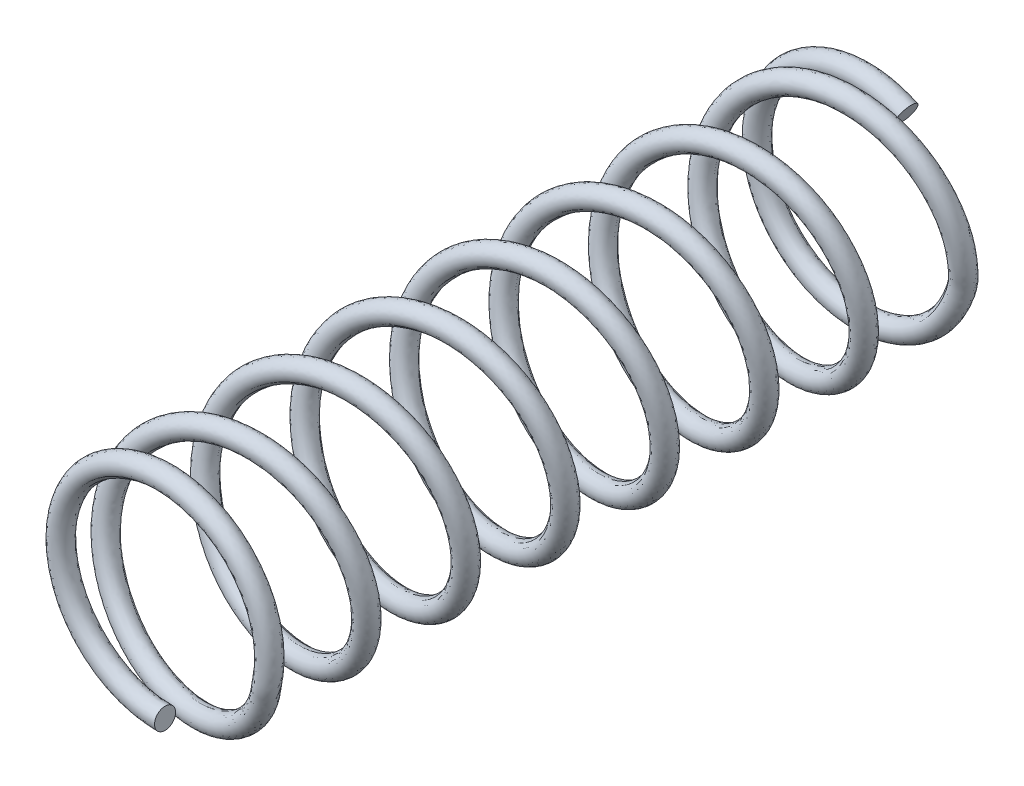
ISO-10303-21;
HEADER;
FILE_DESCRIPTION(('STEP AP214'),'2;1');
FILE_NAME('part.step','',(''),(''),'','','');
FILE_SCHEMA(('AUTOMOTIVE_DESIGN { 1 0 10303 214 1 1 1 1 }'));
ENDSEC;
DATA;
#1=APPLICATION_CONTEXT('core data for automotive mechanical design processes');
#2=APPLICATION_PROTOCOL_DEFINITION('international standard','automotive_design',2000,#1);
#3=PRODUCT_CONTEXT('',#1,'mechanical');
#4=PRODUCT('Part','Part','',(#3));
#5=PRODUCT_RELATED_PRODUCT_CATEGORY('part','',(#4));
#6=PRODUCT_DEFINITION_FORMATION('','',#4);
#7=PRODUCT_DEFINITION_CONTEXT('part definition',#1,'design');
#8=PRODUCT_DEFINITION('design','',#6,#7);
#9=PRODUCT_DEFINITION_SHAPE('','',#8);
#10=(LENGTH_UNIT() NAMED_UNIT(*) SI_UNIT(.MILLI.,.METRE.));
#11=(NAMED_UNIT(*) PLANE_ANGLE_UNIT() SI_UNIT($,.RADIAN.));
#12=(NAMED_UNIT(*) SI_UNIT($,.STERADIAN.) SOLID_ANGLE_UNIT());
#13=UNCERTAINTY_MEASURE_WITH_UNIT(LENGTH_MEASURE(1.E-05),#10,'distance_accuracy_value','');
#14=(GEOMETRIC_REPRESENTATION_CONTEXT(3) GLOBAL_UNCERTAINTY_ASSIGNED_CONTEXT((#13)) GLOBAL_UNIT_ASSIGNED_CONTEXT((#10,
#11,#12)) REPRESENTATION_CONTEXT('',''));
#15=CARTESIAN_POINT('',(0.,0.,0.));
#16=DIRECTION('',(0.,0.,1.));
#17=DIRECTION('',(1.,0.,0.));
#18=AXIS2_PLACEMENT_3D('',#15,#16,#17);
#19=CARTESIAN_POINT('',(0.,-2.7686,9.2456));
#20=DIRECTION('',(1.,0.,0.));
#21=DIRECTION('',(0.,0.,-1.));
#22=AXIS2_PLACEMENT_3D('',#19,#20,#21);
#23=PLANE('',#22);
#24=CARTESIAN_POINT('',(0.,-2.7686,9.2456));
#25=DIRECTION('',(1.,0.,0.));
#26=DIRECTION('',(0.,0.,-1.));
#27=AXIS2_PLACEMENT_3D('',#24,#25,#26);
#28=CIRCLE('',#27,0.279399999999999);
#29=CARTESIAN_POINT('',(0.,-2.7686,8.9662));
#30=VERTEX_POINT('',#29);
#31=EDGE_CURVE('E41',#30,#30,#28,.T.);
#32=ORIENTED_EDGE('',*,*,#31,.T.);
#33=EDGE_LOOP('',(#32));
#34=FACE_BOUND('',#33,.T.);
#35=ADVANCED_FACE('F34',(#34),#23,.T.);
#36=CARTESIAN_POINT('',(1.2002935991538,2.49488301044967,-9.2456));
#37=DIRECTION('',(-0.901135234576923,0.433538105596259,0.));
#38=DIRECTION('',(0.,0.,-1.));
#39=AXIS2_PLACEMENT_3D('',#36,#37,#38);
#40=PLANE('',#39);
#41=CARTESIAN_POINT('',(1.2002935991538,2.49488301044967,-9.2456));
#42=DIRECTION('',(-0.901135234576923,0.433538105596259,0.));
#43=DIRECTION('',(0.,0.,-1.));
#44=AXIS2_PLACEMENT_3D('',#41,#42,#43);
#45=CIRCLE('',#44,0.279399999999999);
#46=CARTESIAN_POINT('',(1.2002935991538,2.49488301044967,-9.525));
#47=VERTEX_POINT('',#46);
#48=EDGE_CURVE('E11',#47,#47,#45,.T.);
#49=ORIENTED_EDGE('',*,*,#48,.F.);
#50=EDGE_LOOP('',(#49));
#51=FACE_BOUND('',#50,.T.);
#52=ADVANCED_FACE('F50',(#51),#40,.F.);
#53=CARTESIAN_POINT('',(0.,-2.7686,8.9662));
#54=CARTESIAN_POINT('',(-0.37236914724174,-2.76860003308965,8.9662));
#55=CARTESIAN_POINT('',(-0.809817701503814,-2.69170561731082,8.9662));
#56=CARTESIAN_POINT('',(-1.6234633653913,-2.28256995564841,8.9662));
#57=CARTESIAN_POINT('',(-1.99242678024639,-1.97930861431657,8.9662));
#58=CARTESIAN_POINT('',(-2.54581644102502,-1.19207591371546,8.9662));
#59=CARTESIAN_POINT('',(-2.71652742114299,-0.704766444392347,8.9662));
#60=CARTESIAN_POINT('',(-2.79944352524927,0.257511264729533,8.9662));
#61=CARTESIAN_POINT('',(-2.7042506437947,0.72389089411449,8.9662));
#62=CARTESIAN_POINT('',(-2.36341885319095,1.50245045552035,8.9662));
#63=CARTESIAN_POINT('',(-2.13073673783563,1.80690828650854,8.9662));
#64=CARTESIAN_POINT('',(-1.62614763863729,2.27153307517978,8.9662));
#65=CARTESIAN_POINT('',(-1.32878670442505,2.46135199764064,8.9662));
#66=CARTESIAN_POINT('',(-0.576215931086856,2.73655034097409,8.9662));
#67=CARTESIAN_POINT('',(-0.1288594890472,2.8061342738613,8.9662));
#68=CARTESIAN_POINT('',(0.804905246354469,2.68676395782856,8.9662));
#69=CARTESIAN_POINT('',(1.28273164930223,2.50313834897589,8.9662));
#70=CARTESIAN_POINT('',(2.05973078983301,1.91037767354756,8.9662));
#71=CARTESIAN_POINT('',(2.36045855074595,1.51391897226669,8.9662));
#72=CARTESIAN_POINT('',(2.74171236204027,0.63840391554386,8.9662));
#73=CARTESIAN_POINT('',(2.79305893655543,0.164917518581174,8.96618389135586));
#74=CARTESIAN_POINT('',(2.74104494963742,-0.438908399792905,8.96620805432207));
#75=CARTESIAN_POINT('',(2.7043917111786,-0.621593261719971,8.97594097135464));
#76=CARTESIAN_POINT('',(2.59673811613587,-0.977175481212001,8.90351607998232));
#77=CARTESIAN_POINT('',(2.52515601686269,-1.1492578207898,8.88094189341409));
#78=CARTESIAN_POINT('',(2.08467584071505,-1.96823656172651,8.739737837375));
#79=CARTESIAN_POINT('',(1.45852916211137,-2.46693510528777,8.62713447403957));
#80=CARTESIAN_POINT('',(0.0283918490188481,-2.86658603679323,8.40161676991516));
#81=CARTESIAN_POINT('',(-0.766037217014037,-2.76168266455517,8.2888894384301));
#82=CARTESIAN_POINT('',(-2.04553882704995,-2.00841005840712,8.06340552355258));
#83=CARTESIAN_POINT('',(-2.52099753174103,-1.36328109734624,7.95066595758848));
#84=CARTESIAN_POINT('',(-2.86555299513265,0.0809194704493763,7.72518451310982));
#85=CARTESIAN_POINT('',(-2.73053645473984,0.87093593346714,7.6124439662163));
#86=CARTESIAN_POINT('',(-1.92891289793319,2.12062578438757,7.38696269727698));
#87=CARTESIAN_POINT('',(-1.26612145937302,2.57136055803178,7.27422207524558));
#88=CARTESIAN_POINT('',(0.190163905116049,2.86027285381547,7.04874081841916));
#89=CARTESIAN_POINT('',(0.974633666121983,2.69552755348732,6.93600019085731));
#90=CARTESIAN_POINT('',(2.19252934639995,1.84645852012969,6.71051893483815));
#91=CARTESIAN_POINT('',(2.61810720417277,1.16715411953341,6.59777830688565));
#92=CARTESIAN_POINT('',(2.85063582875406,-0.299175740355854,6.37229705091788));
#93=CARTESIAN_POINT('',(2.65662579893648,-1.07691788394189,6.25955642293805));
#94=CARTESIAN_POINT('',(1.761216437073,-2.2611862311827,6.03407516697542));
#95=CARTESIAN_POINT('',(1.066477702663,-2.66090772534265,5.9213345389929));
#96=CARTESIAN_POINT('',(-0.40775702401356,-2.83690244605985,5.6958532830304));
#97=CARTESIAN_POINT('',(-1.17750865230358,-2.61369915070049,5.58311265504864));
#98=CARTESIAN_POINT('',(-2.32664327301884,-1.67351508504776,5.35763139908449));
#99=CARTESIAN_POINT('',(-2.69965765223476,-0.964228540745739,5.24489077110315));
#100=CARTESIAN_POINT('',(-2.81917871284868,0.515735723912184,5.0194095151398));
#101=CARTESIAN_POINT('',(-2.56685243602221,1.276294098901,4.9066688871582));
#102=CARTESIAN_POINT('',(-1.58347448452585,2.38879943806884,4.68118763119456));
#103=CARTESIAN_POINT('',(-0.860561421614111,2.73436125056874,4.56844700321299));
#104=CARTESIAN_POINT('',(0.622957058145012,2.79746898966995,4.34296574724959));
#105=CARTESIAN_POINT('',(1.37316778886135,2.51619812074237,4.23022511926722));
#106=CARTESIAN_POINT('',(2.44754836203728,1.49120716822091,4.00474386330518));
#107=CARTESIAN_POINT('',(2.76502278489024,0.755631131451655,3.89200323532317));
#108=CARTESIAN_POINT('',(2.77177763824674,-0.729266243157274,3.66652197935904));
#109=CARTESIAN_POINT('',(2.46184867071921,-1.46802328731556,3.55378135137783));
#110=CARTESIAN_POINT('',(1.39682566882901,-2.5027836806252,3.32830009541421));
#111=CARTESIAN_POINT('',(0.649592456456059,-2.7916465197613,3.21555946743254));
#112=CARTESIAN_POINT('',(-0.834508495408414,-2.7421090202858,2.99007821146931));
#113=CARTESIAN_POINT('',(-1.56075415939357,-2.40391655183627,2.8773375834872));
#114=CARTESIAN_POINT('',(-2.55439902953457,-1.30044251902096,2.65185632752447));
#115=CARTESIAN_POINT('',(-2.81423671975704,-0.542600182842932,2.53911569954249));
#116=CARTESIAN_POINT('',(-2.70846749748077,0.938529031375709,2.313634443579));
#117=CARTESIAN_POINT('',(-2.34251422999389,1.65125397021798,2.20089381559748));
#118=CARTESIAN_POINT('',(-1.20217025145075,2.60228804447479,1.97541255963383));
#119=CARTESIAN_POINT('',(-0.434809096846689,2.83279764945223,1.86267193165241));
#120=CARTESIAN_POINT('',(1.04117306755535,2.67085743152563,1.63719067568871));
#121=CARTESIAN_POINT('',(1.73941628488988,2.27775417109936,1.52445004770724));
#122=CARTESIAN_POINT('',(2.64634436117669,1.10212139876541,1.2989687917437));
#123=CARTESIAN_POINT('',(2.84733357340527,0.326373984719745,1.18622816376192));
#124=CARTESIAN_POINT('',(2.62928318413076,-1.14228582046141,0.960746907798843));
#125=CARTESIAN_POINT('',(2.20974884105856,-1.82513466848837,0.848006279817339));
#126=CARTESIAN_POINT('',(1.00040849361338,-2.68646161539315,0.62252502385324));
#127=CARTESIAN_POINT('',(0.217449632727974,-2.85784875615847,0.509784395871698));
#128=CARTESIAN_POINT('',(-1.2417125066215,-2.58374911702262,0.2843031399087));
#129=CARTESIAN_POINT('',(-1.90830268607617,-2.13861070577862,0.171562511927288));
#130=CARTESIAN_POINT('',(-2.72253344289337,-0.89714406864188,-0.0539187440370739));
#131=CARTESIAN_POINT('',(-2.86434746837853,-0.10819081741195,-0.166659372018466));
#132=CARTESIAN_POINT('',(-2.53425958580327,1.33929833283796,-0.392140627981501));
#133=CARTESIAN_POINT('',(-2.06442467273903,1.98877012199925,-0.50488125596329));
#134=CARTESIAN_POINT('',(-0.792469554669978,2.75449939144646,-0.730362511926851));
#135=CARTESIAN_POINT('',(0.00120280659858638,2.86663705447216,-0.843103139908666));
#136=CARTESIAN_POINT('',(1.43493786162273,2.48103550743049,-1.06858439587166));
#137=CARTESIAN_POINT('',(2.06618682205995,1.98715001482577,-1.18132502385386));
#138=CARTESIAN_POINT('',(2.7825479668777,0.686682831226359,-1.40680627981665));
#139=CARTESIAN_POINT('',(2.86456414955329,-0.110540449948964,-1.51954690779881));
#140=CARTESIAN_POINT('',(2.42433704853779,-1.528534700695,-1.74502816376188));
#141=CARTESIAN_POINT('',(1.90690252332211,-2.14045154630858,-1.85776879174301));
#142=CARTESIAN_POINT('',(0.579956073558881,-2.80666778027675,-2.08325004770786));
#143=CARTESIAN_POINT('',(-0.219680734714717,-2.85819193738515,-2.19599067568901));
#144=CARTESIAN_POINT('',(-1.61994752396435,-2.36422746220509,-2.42147193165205));
#145=CARTESIAN_POINT('',(-2.2115090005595,-1.82382683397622,-2.53421255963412));
#146=CARTESIAN_POINT('',(-2.82680362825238,-0.472433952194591,-2.75969381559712));
#147=CARTESIAN_POINT('',(-2.84758359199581,0.328482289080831,-2.87243444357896));
#148=CARTESIAN_POINT('',(-2.30077001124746,1.70903499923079,-3.09791569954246));
#149=CARTESIAN_POINT('',(-1.73806758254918,2.27930389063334,-3.21065632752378));
#150=CARTESIAN_POINT('',(-0.364261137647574,2.84290030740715,-3.43613758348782));
#151=CARTESIAN_POINT('',(0.436803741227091,2.83280228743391,-3.54887821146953));
#152=CARTESIAN_POINT('',(1.7956557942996,2.23402795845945,-3.77435946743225));
#153=CARTESIAN_POINT('',(2.34378092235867,1.64976940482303,-3.88710009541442));
#154=CARTESIAN_POINT('',(2.85490261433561,0.25558230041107,-4.11258135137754));
#155=CARTESIAN_POINT('',(2.81391119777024,-0.54450371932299,-4.2253219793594));
#156=CARTESIAN_POINT('',(2.16406456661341,-1.87966857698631,-4.45080323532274));
#157=CARTESIAN_POINT('',(1.55907693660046,-2.40488480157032,-4.56354386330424));
#158=CARTESIAN_POINT('',(0.146542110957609,-2.8627553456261,-4.78902511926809));
#159=CARTESIAN_POINT('',(-0.651440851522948,-2.79097349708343,-4.90176574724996));
#160=CARTESIAN_POINT('',(-1.96093201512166,-2.09094309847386,-5.12724700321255));
#161=CARTESIAN_POINT('',(-2.46256023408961,-1.46613481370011,-5.23998763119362));
#162=CARTESIAN_POINT('',(-2.86640329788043,-0.0372852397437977,-5.46546888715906));
#163=CARTESIAN_POINT('',(-2.76405235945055,0.75747376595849,-5.57820951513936));
#164=CARTESIAN_POINT('',(-2.01472681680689,2.0393047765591,-5.80369077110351));
#165=CARTESIAN_POINT('',(-1.37108767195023,2.51675192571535,-5.91643139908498));
#166=CARTESIAN_POINT('',(0.0720436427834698,2.86579126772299,-6.14191265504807));
#167=CARTESIAN_POINT('',(0.86246109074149,2.73321095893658,-6.25465328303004));
#168=CARTESIAN_POINT('',(2.11464552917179,1.93547898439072,-6.48013453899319));
#169=CARTESIAN_POINT('',(2.56740458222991,1.27408014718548,-6.59287516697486));
#170=CARTESIAN_POINT('',(2.86086405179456,-0.181299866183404,-6.81835642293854));
#171=CARTESIAN_POINT('',(2.69851246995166,-0.966261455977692,-6.9310970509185));
#172=CARTESIAN_POINT('',(1.85326286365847,-2.18681293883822,-7.15657830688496));
#173=CARTESIAN_POINT('',(1.17525531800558,-2.61445385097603,-7.26931893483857));
#174=CARTESIAN_POINT('',(-0.29033717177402,-2.85157568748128,-7.49480019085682));
#175=CARTESIAN_POINT('',(-1.0686738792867,-2.65993594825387,-7.60754081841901));
#176=CARTESIAN_POINT('',(-2.25572944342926,-1.76823170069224,-7.83302207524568));
#177=CARTESIAN_POINT('',(-2.65758346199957,-1.07471337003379,-7.94576269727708));
#178=CARTESIAN_POINT('',(-2.83816652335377,0.398960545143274,-8.17124396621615));
#179=CARTESIAN_POINT('',(-2.61733244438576,1.16940703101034,-8.28398451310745));
#180=CARTESIAN_POINT('',(-1.76853230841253,2.21344517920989,-8.4883270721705));
#181=CARTESIAN_POINT('',(-1.22970672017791,2.54890215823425,-8.579928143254));
#182=CARTESIAN_POINT('',(-0.0587292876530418,2.83414400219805,-8.76313257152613));
#183=CARTESIAN_POINT('',(0.573095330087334,2.77064193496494,-8.85473013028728));
#184=CARTESIAN_POINT('',(1.67613029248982,2.28339419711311,-9.0379353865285));
#185=CARTESIAN_POINT('',(2.14116790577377,1.85234230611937,-9.12953774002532));
#186=CARTESIAN_POINT('',(2.57283187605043,1.05758696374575,-9.26690952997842));
#187=CARTESIAN_POINT('',(2.67454061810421,0.769632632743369,-9.31271272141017));
#188=CARTESIAN_POINT('',(2.77954059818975,0.175601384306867,-9.40442160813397));
#189=CARTESIAN_POINT('',(2.78151376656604,-0.130499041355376,-9.43968330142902));
#190=CARTESIAN_POINT('',(2.68864827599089,-0.727035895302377,-9.55737374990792));
#191=CARTESIAN_POINT('',(2.5953148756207,-1.02803388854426,-9.525));
#192=CARTESIAN_POINT('',(2.2484295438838,-1.65336042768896,-9.525));
#193=CARTESIAN_POINT('',(1.99733750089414,-1.96514669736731,-9.525));
#194=CARTESIAN_POINT('',(1.31733273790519,-2.46919078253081,-9.525));
#195=CARTESIAN_POINT('',(0.895021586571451,-2.65799389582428,-9.525));
#196=CARTESIAN_POINT('',(-0.0025874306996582,-2.80657185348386,-9.525));
#197=CARTESIAN_POINT('',(-0.471386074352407,-2.75947855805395,-9.525));
#198=CARTESIAN_POINT('',(-1.30078596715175,-2.48345717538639,-9.525));
#199=CARTESIAN_POINT('',(-1.6526656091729,-2.25211346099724,-9.525));
#200=CARTESIAN_POINT('',(-2.19502913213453,-1.72803283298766,-9.525));
#201=CARTESIAN_POINT('',(-2.38415448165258,-1.44555205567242,-9.525));
#202=CARTESIAN_POINT('',(-2.65316056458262,-0.870099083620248,-9.525));
#203=CARTESIAN_POINT('',(-2.74012162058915,-0.551003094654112,-9.525));
#204=CARTESIAN_POINT('',(-2.78541337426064,0.206068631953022,-9.525));
#205=CARTESIAN_POINT('',(-2.73233621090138,0.625037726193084,-9.525));
#206=CARTESIAN_POINT('',(-2.4192635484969,1.4054147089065,-9.525));
#207=CARTESIAN_POINT('',(-2.17253475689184,1.761208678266,-9.525));
#208=CARTESIAN_POINT('',(-1.55388613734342,2.3302857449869,-9.525));
#209=CARTESIAN_POINT('',(-1.17879233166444,2.53435882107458,-9.525));
#210=CARTESIAN_POINT('',(-0.419491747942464,2.76326788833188,-9.525));
#211=CARTESIAN_POINT('',(-0.0370029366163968,2.78958435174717,-9.525));
#212=CARTESIAN_POINT('',(0.644191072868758,2.71391135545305,-9.525));
#213=CARTESIAN_POINT('',(0.948627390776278,2.61596019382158,-9.525));
#214=CARTESIAN_POINT('',(1.2002935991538,2.49488301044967,-9.525));
#215=CARTESIAN_POINT('',(0.,-2.2098,8.9662));
#216=CARTESIAN_POINT('',(-0.294614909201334,-2.20980003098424,8.9662));
#217=CARTESIAN_POINT('',(-0.649980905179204,-2.14660813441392,8.9662));
#218=CARTESIAN_POINT('',(-1.29263079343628,-1.82345803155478,8.9662));
#219=CARTESIAN_POINT('',(-1.5923602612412,-1.57674510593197,8.9662));
#220=CARTESIAN_POINT('',(-2.03158073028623,-0.951925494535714,8.9662));
#221=CARTESIAN_POINT('',(-2.16806272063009,-0.560790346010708,8.9662));
#222=CARTESIAN_POINT('',(-2.23443416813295,0.209479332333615,8.9662));
#223=CARTESIAN_POINT('',(-2.15871044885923,0.576646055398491,8.9662));
#224=CARTESIAN_POINT('',(-1.88516400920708,1.20150618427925,8.9662));
#225=CARTESIAN_POINT('',(-1.6949783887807,1.44854143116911,8.9662));
#226=CARTESIAN_POINT('',(-1.30487222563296,1.80775052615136,8.9662));
#227=CARTESIAN_POINT('',(-1.06209605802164,1.96388527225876,8.9662));
#228=CARTESIAN_POINT('',(-0.459082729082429,2.18439379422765,8.9662));
#229=CARTESIAN_POINT('',(-0.106627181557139,2.23994456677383,8.9662));
#230=CARTESIAN_POINT('',(0.640954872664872,2.14437540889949,8.9662));
#231=CARTESIAN_POINT('',(1.02429482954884,1.99745227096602,8.9662));
#232=CARTESIAN_POINT('',(1.64030296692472,1.52750914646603,8.9662));
#233=CARTESIAN_POINT('',(1.88585781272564,1.20417481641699,8.9662));
#234=CARTESIAN_POINT('',(2.18625683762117,0.514331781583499,8.9662));
#235=CARTESIAN_POINT('',(2.22939148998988,0.132426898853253,8.96618389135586));
#236=CARTESIAN_POINT('',(2.18777190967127,-0.350719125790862,8.96620805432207));
#237=CARTESIAN_POINT('',(2.15895647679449,-0.494713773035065,8.97594097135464));
#238=CARTESIAN_POINT('',(2.07251938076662,-0.780218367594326,8.90351607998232));
#239=CARTESIAN_POINT('',(2.01491334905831,-0.918235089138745,8.88094189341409));
#240=CARTESIAN_POINT('',(1.66496515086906,-1.56889133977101,8.739737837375));
#241=CARTESIAN_POINT('',(1.15674145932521,-1.97106055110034,8.62713447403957));
#242=CARTESIAN_POINT('',(0.0293898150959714,-2.2860985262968,8.40161676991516));
#243=CARTESIAN_POINT('',(-0.618176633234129,-2.20028385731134,8.2888894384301));
#244=CARTESIAN_POINT('',(-1.62640507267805,-1.60671635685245,8.06340552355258));
#245=CARTESIAN_POINT('',(-2.01398396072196,-1.08048204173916,7.95066595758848));
#246=CARTESIAN_POINT('',(-2.28547701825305,0.0574774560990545,7.72518451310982));
#247=CARTESIAN_POINT('',(-2.17519223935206,0.701728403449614,7.6124439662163));
#248=CARTESIAN_POINT('',(-1.54355752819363,1.68641467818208,7.38696269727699));
#249=CARTESIAN_POINT('',(-1.00297469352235,2.05387551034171,7.27422207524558));
#250=CARTESIAN_POINT('',(0.144499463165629,2.28152289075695,7.04874081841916));
#251=CARTESIAN_POINT('',(0.784182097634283,2.14710916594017,6.93600019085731));
#252=CARTESIAN_POINT('',(1.74382767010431,1.47808200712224,6.71051893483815));
#253=CARTESIAN_POINT('',(2.09085703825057,0.924168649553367,6.59777830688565));
#254=CARTESIAN_POINT('',(2.27407862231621,-0.231230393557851,6.37229705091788));
#255=CARTESIAN_POINT('',(2.11595360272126,-0.865468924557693,6.25955642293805));
#256=CARTESIAN_POINT('',(1.41042008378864,-1.79860730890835,6.03407516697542));
#257=CARTESIAN_POINT('',(0.843929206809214,-2.12470789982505,5.9213345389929));
#258=CARTESIAN_POINT('',(-0.317686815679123,-2.26338191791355,5.6958532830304));
#259=CARTESIAN_POINT('',(-0.945494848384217,-2.08152688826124,5.58311265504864));
#260=CARTESIAN_POINT('',(-1.85095768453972,-1.34070681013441,5.35763139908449));
#261=CARTESIAN_POINT('',(-2.15534255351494,-0.762343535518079,5.24489077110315));
#262=CARTESIAN_POINT('',(-2.24952056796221,0.403813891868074,5.0194095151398));
#263=CARTESIAN_POINT('',(-2.04392156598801,1.02414713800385,4.9066688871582));
#264=CARTESIAN_POINT('',(-1.26904287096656,1.90077491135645,4.68118763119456));
#265=CARTESIAN_POINT('',(-0.679551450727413,2.18275598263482,4.56844700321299));
#266=CARTESIAN_POINT('',(0.489445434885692,2.23248406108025,4.34296574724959));
#267=CARTESIAN_POINT('',(1.10132281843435,2.00323450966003,4.23022511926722));
#268=CARTESIAN_POINT('',(1.94793558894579,1.19554063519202,4.00474386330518));
#269=CARTESIAN_POINT('',(2.20694458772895,0.5956972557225,3.89200323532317));
#270=CARTESIAN_POINT('',(2.21226739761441,-0.574416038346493,3.66652197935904));
#271=CARTESIAN_POINT('',(1.95956792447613,-1.17691596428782,3.55378135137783));
#272=CARTESIAN_POINT('',(1.12031430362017,-1.99232216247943,3.32830009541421));
#273=CARTESIAN_POINT('',(0.510930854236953,-2.22790695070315,3.21555946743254));
#274=CARTESIAN_POINT('',(-0.65856356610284,-2.1888706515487,2.99007821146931));
#275=CARTESIAN_POINT('',(-1.25081876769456,-1.91302965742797,2.8773375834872));
#276=CARTESIAN_POINT('',(-2.03382299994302,-1.04347880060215,2.65185632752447));
#277=CARTESIAN_POINT('',(-2.24564476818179,-0.425407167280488,2.53911569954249));
#278=CARTESIAN_POINT('',(-2.16229820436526,0.741729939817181,2.313634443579));
#279=CARTESIAN_POINT('',(-1.86373338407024,1.32292261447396,2.20089381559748));
#280=CARTESIAN_POINT('',(-0.965148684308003,2.07233234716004,1.97541255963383));
#281=CARTESIAN_POINT('',(-0.339285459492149,2.26016370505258,1.86267193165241));
#282=CARTESIAN_POINT('',(0.823761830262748,2.13255790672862,1.63719067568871));
#283=CARTESIAN_POINT('',(1.39311916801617,1.8117986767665,1.52445004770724));
#284=CARTESIAN_POINT('',(2.10775016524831,0.885437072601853,1.2989687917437));
#285=CARTESIAN_POINT('',(2.2714741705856,0.252728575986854,1.18622816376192));
#286=CARTESIAN_POINT('',(2.09966016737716,-0.904511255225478,0.960746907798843));
#287=CARTESIAN_POINT('',(1.75735095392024,-1.46130146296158,0.848006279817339));
#288=CARTESIAN_POINT('',(0.804454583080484,-2.13998184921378,0.62252502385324));
#289=CARTESIAN_POINT('',(0.165902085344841,-2.27959201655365,0.509784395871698));
#290=CARTESIAN_POINT('',(-0.983836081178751,-2.0636169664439,0.2843031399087));
#291=CARTESIAN_POINT('',(-1.52736501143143,-1.70052130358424,0.171562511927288));
#292=CARTESIAN_POINT('',(-2.16893782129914,-0.722308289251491,-0.0539187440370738));
#293=CARTESIAN_POINT('',(-2.28453711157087,-0.0789643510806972,-0.166659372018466));
#294=CARTESIAN_POINT('',(-2.02444283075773,1.06159145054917,-0.392140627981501));
#295=CARTESIAN_POINT('',(-1.64135812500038,1.59121464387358,-0.50488125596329));
#296=CARTESIAN_POINT('',(-0.639121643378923,2.19457059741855,-0.730362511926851));
#297=CARTESIAN_POINT('',(0.0080872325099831,2.28612838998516,-0.843103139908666));
#298=CARTESIAN_POINT('',(1.13779021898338,1.98229581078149,-1.06858439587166));
#299=CARTESIAN_POINT('',(1.65268604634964,1.57965132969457,-1.18132502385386));
#300=CARTESIAN_POINT('',(2.21714073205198,0.55495163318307,-1.40680627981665));
#301=CARTESIAN_POINT('',(2.28421785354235,-0.0951957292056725,-1.51954690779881));
#302=CARTESIAN_POINT('',(1.93733794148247,-1.21251323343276,-1.74502816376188));
#303=CARTESIAN_POINT('',(1.51549722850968,-1.71168855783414,-1.85776879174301));
#304=CARTESIAN_POINT('',(0.469905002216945,-2.23664587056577,-2.08325004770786));
#305=CARTESIAN_POINT('',(-0.182224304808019,-2.27885521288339,-2.19599067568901));
#306=CARTESIAN_POINT('',(-1.2856091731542,-1.88961997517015,-2.42147193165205));
#307=CARTESIAN_POINT('',(-1.76816452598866,-1.4490229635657,-2.53421255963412));
#308=CARTESIAN_POINT('',(-2.25301318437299,-0.384132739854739,-2.75969381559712));
#309=CARTESIAN_POINT('',(-2.2700912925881,0.269039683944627,-2.87243444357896));
#310=CARTESIAN_POINT('',(-1.83919940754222,1.35692196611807,-3.09791569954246));
#311=CARTESIAN_POINT('',(-1.38036174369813,1.82205528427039,-3.21065632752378));
#312=CARTESIAN_POINT('',(-0.297785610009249,2.26617602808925,-3.43613758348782));
#313=CARTESIAN_POINT('',(0.355504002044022,2.25798086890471,-3.54887821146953));
#314=CARTESIAN_POINT('',(1.42630035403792,1.78613745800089,-3.77435946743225));
#315=CARTESIAN_POINT('',(1.87330226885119,1.3096527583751,-3.88710009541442));
#316=CARTESIAN_POINT('',(2.27607361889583,0.211013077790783,-4.11258135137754));
#317=CARTESIAN_POINT('',(2.2425833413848,-0.44147568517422,-4.2253219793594));
#318=CARTESIAN_POINT('',(1.73049806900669,-1.49359836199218,-4.45080323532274));
#319=CARTESIAN_POINT('',(1.23704097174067,-1.92184809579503,-4.56354386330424));
#320=CARTESIAN_POINT('',(0.123962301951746,-2.28265060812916,-4.78902511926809));
#321=CARTESIAN_POINT('',(-0.526810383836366,-2.22396329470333,-4.90176574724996));
#322=CARTESIAN_POINT('',(-1.55867564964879,-1.6723468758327,-5.12724700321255));
#323=CARTESIAN_POINT('',(-1.96763759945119,-1.1626768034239,-5.23998763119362));
#324=CARTESIAN_POINT('',(-2.2858565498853,-0.0367771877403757,-5.46546888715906));
#325=CARTESIAN_POINT('',(-2.20219095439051,0.611361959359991,-5.57820951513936));
#326=CARTESIAN_POINT('',(-1.61175014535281,1.62139774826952,-5.80369077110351));
#327=CARTESIAN_POINT('',(-1.08671569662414,2.01061883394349,-5.91643139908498));
#328=CARTESIAN_POINT('',(0.0504025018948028,2.28564526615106,-6.14191265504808));
#329=CARTESIAN_POINT('',(0.694983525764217,2.17734253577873,-6.25465328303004));
#330=CARTESIAN_POINT('',(1.68163618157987,1.54877368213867,-6.48013453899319));
#331=CARTESIAN_POINT('',(2.05074403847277,1.0093175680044,-6.59287516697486));
#332=CARTESIAN_POINT('',(2.28197410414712,-0.137441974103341,-6.81835642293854));
#333=CARTESIAN_POINT('',(2.14949955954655,-0.777529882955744,-6.9310970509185));
#334=CARTESIAN_POINT('',(1.48348262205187,-1.73926713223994,-7.15657830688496));
#335=CARTESIAN_POINT('',(0.930619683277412,-2.08796752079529,-7.26931893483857));
#336=CARTESIAN_POINT('',(-0.224199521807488,-2.27480854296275,-7.49480019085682));
#337=CARTESIAN_POINT('',(-0.858913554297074,-2.11860668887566,-7.60754081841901));
#338=CARTESIAN_POINT('',(-1.79424913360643,-1.41599184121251,-7.83302207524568));
#339=CARTESIAN_POINT('',(-2.12207910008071,-0.850496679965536,-7.94576269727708));
#340=CARTESIAN_POINT('',(-2.26436837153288,0.310676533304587,-8.17124396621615));
#341=CARTESIAN_POINT('',(-2.08444253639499,0.939046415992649,-8.28398451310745));
#342=CARTESIAN_POINT('',(-1.41562934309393,1.76169740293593,-8.4883270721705));
#343=CARTESIAN_POINT('',(-0.978287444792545,2.03500611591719,-8.579928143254));
#344=CARTESIAN_POINT('',(-0.0456435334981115,2.26219159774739,-8.76313257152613));
#345=CARTESIAN_POINT('',(0.456428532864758,2.21128658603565,-8.85473013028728));
#346=CARTESIAN_POINT('',(1.34121198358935,1.82044790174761,-9.0379353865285));
#347=CARTESIAN_POINT('',(1.70681285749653,1.48126167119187,-9.12953774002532));
#348=CARTESIAN_POINT('',(2.05344204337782,0.843067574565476,-9.26690952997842));
#349=CARTESIAN_POINT('',(2.13502732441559,0.611512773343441,-9.31271272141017));
#350=CARTESIAN_POINT('',(2.21851402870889,0.139191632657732,-9.40442160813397));
#351=CARTESIAN_POINT('',(2.22021388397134,-0.103323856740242,-9.43968330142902));
#352=CARTESIAN_POINT('',(2.14564977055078,-0.582295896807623,-9.55737374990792));
#353=CARTESIAN_POINT('',(2.07204688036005,-0.819369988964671,-9.525));
#354=CARTESIAN_POINT('',(1.79439566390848,-1.31988891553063,-9.525));
#355=CARTESIAN_POINT('',(1.59400617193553,-1.56853776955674,-9.525));
#356=CARTESIAN_POINT('',(1.05515060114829,-1.96795696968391,-9.525));
#357=CARTESIAN_POINT('',(0.708995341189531,-2.12238259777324,-9.525));
#358=CARTESIAN_POINT('',(0.000929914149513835,-2.23958609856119,-9.525));
#359=CARTESIAN_POINT('',(-0.377620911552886,-2.20175114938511,-9.525));
#360=CARTESIAN_POINT('',(-1.04164735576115,-1.980765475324,-9.525));
#361=CARTESIAN_POINT('',(-1.31824054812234,-1.79820820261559,-9.525));
#362=CARTESIAN_POINT('',(-1.75285384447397,-1.37824557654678,-9.525));
#363=CARTESIAN_POINT('',(-1.90776221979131,-1.14510453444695,-9.525));
#364=CARTESIAN_POINT('',(-2.11711383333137,-0.697263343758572,-9.525));
#365=CARTESIAN_POINT('',(-2.18689510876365,-0.44113964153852,-9.525));
#366=CARTESIAN_POINT('',(-2.22303449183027,0.162946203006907,-9.525));
#367=CARTESIAN_POINT('',(-2.17881990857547,0.503955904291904,-9.525));
#368=CARTESIAN_POINT('',(-1.93285083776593,1.11707064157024,-9.525));
#369=CARTESIAN_POINT('',(-1.73237045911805,1.40684156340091,-9.525));
#370=CARTESIAN_POINT('',(-1.23742941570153,1.8621235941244,-9.525));
#371=CARTESIAN_POINT('',(-0.943364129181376,2.02169273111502,-9.525));
#372=CARTESIAN_POINT('',(-0.332333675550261,2.20590227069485,-9.525));
#373=CARTESIAN_POINT('',(-0.029833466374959,2.22655048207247,-9.525));
#374=CARTESIAN_POINT('',(0.513627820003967,2.16617804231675,-9.525));
#375=CARTESIAN_POINT('',(0.758916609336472,2.08712375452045,-9.525));
#376=CARTESIAN_POINT('',(0.958032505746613,1.99132864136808,-9.525));
#377=CARTESIAN_POINT('',(0.,-2.2098,9.525));
#378=CARTESIAN_POINT('',(-0.294614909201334,-2.20980003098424,9.525));
#379=CARTESIAN_POINT('',(-0.649980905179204,-2.14660813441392,9.525));
#380=CARTESIAN_POINT('',(-1.29263079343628,-1.82345803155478,9.525));
#381=CARTESIAN_POINT('',(-1.5923602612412,-1.57674510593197,9.525));
#382=CARTESIAN_POINT('',(-2.03158073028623,-0.951925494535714,9.525));
#383=CARTESIAN_POINT('',(-2.16806272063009,-0.560790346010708,9.525));
#384=CARTESIAN_POINT('',(-2.23443416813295,0.209479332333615,9.525));
#385=CARTESIAN_POINT('',(-2.15871044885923,0.576646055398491,9.525));
#386=CARTESIAN_POINT('',(-1.88516400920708,1.20150618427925,9.525));
#387=CARTESIAN_POINT('',(-1.6949783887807,1.44854143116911,9.525));
#388=CARTESIAN_POINT('',(-1.30487222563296,1.80775052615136,9.525));
#389=CARTESIAN_POINT('',(-1.06209605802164,1.96388527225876,9.525));
#390=CARTESIAN_POINT('',(-0.459082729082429,2.18439379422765,9.525));
#391=CARTESIAN_POINT('',(-0.106627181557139,2.23994456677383,9.525));
#392=CARTESIAN_POINT('',(0.640954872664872,2.14437540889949,9.525));
#393=CARTESIAN_POINT('',(1.02429482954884,1.99745227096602,9.525));
#394=CARTESIAN_POINT('',(1.64030296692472,1.52750914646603,9.525));
#395=CARTESIAN_POINT('',(1.88585781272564,1.20417481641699,9.525));
#396=CARTESIAN_POINT('',(2.18625683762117,0.514331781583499,9.525));
#397=CARTESIAN_POINT('',(2.22939148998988,0.132426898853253,9.52498389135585));
#398=CARTESIAN_POINT('',(2.18777190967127,-0.350719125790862,9.52500805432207));
#399=CARTESIAN_POINT('',(2.15895647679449,-0.494713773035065,9.53474097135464));
#400=CARTESIAN_POINT('',(2.07251938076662,-0.780218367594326,9.46231607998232));
#401=CARTESIAN_POINT('',(2.01491334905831,-0.918235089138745,9.43974189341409));
#402=CARTESIAN_POINT('',(1.66496515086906,-1.56889133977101,9.298537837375));
#403=CARTESIAN_POINT('',(1.15674145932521,-1.97106055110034,9.18593447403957));
#404=CARTESIAN_POINT('',(0.0293898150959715,-2.2860985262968,8.96041676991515));
#405=CARTESIAN_POINT('',(-0.618176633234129,-2.20028385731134,8.8476894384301));
#406=CARTESIAN_POINT('',(-1.62640507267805,-1.60671635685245,8.62220552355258));
#407=CARTESIAN_POINT('',(-2.01398396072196,-1.08048204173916,8.50946595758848));
#408=CARTESIAN_POINT('',(-2.28547701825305,0.0574774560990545,8.28398451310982));
#409=CARTESIAN_POINT('',(-2.17519223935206,0.701728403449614,8.17124396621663));
#410=CARTESIAN_POINT('',(-1.54355752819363,1.68641467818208,7.94576269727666));
#411=CARTESIAN_POINT('',(-1.00297469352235,2.05387551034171,7.83302207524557));
#412=CARTESIAN_POINT('',(0.144499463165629,2.28152289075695,7.60754081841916));
#413=CARTESIAN_POINT('',(0.784182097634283,2.14710916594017,7.49480019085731));
#414=CARTESIAN_POINT('',(1.74382767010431,1.47808200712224,7.26931893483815));
#415=CARTESIAN_POINT('',(2.09085703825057,0.924168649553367,7.15657830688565));
#416=CARTESIAN_POINT('',(2.27407862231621,-0.23123039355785,6.93109705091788));
#417=CARTESIAN_POINT('',(2.11595360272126,-0.865468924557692,6.81835642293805));
#418=CARTESIAN_POINT('',(1.41042008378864,-1.79860730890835,6.59287516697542));
#419=CARTESIAN_POINT('',(0.843929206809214,-2.12470789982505,6.4801345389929));
#420=CARTESIAN_POINT('',(-0.317686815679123,-2.26338191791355,6.2546532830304));
#421=CARTESIAN_POINT('',(-0.945494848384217,-2.08152688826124,6.14191265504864));
#422=CARTESIAN_POINT('',(-1.85095768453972,-1.34070681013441,5.91643139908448));
#423=CARTESIAN_POINT('',(-2.15534255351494,-0.762343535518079,5.80369077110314));
#424=CARTESIAN_POINT('',(-2.24952056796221,0.403813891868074,5.57820951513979));
#425=CARTESIAN_POINT('',(-2.04392156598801,1.02414713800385,5.46546888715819));
#426=CARTESIAN_POINT('',(-1.26904287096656,1.90077491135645,5.23998763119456));
#427=CARTESIAN_POINT('',(-0.679551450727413,2.18275598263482,5.12724700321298));
#428=CARTESIAN_POINT('',(0.489445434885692,2.23248406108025,4.90176574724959));
#429=CARTESIAN_POINT('',(1.10132281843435,2.00323450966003,4.78902511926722));
#430=CARTESIAN_POINT('',(1.94793558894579,1.19554063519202,4.56354386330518));
#431=CARTESIAN_POINT('',(2.20694458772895,0.5956972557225,4.45080323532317));
#432=CARTESIAN_POINT('',(2.21226739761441,-0.574416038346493,4.22532197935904));
#433=CARTESIAN_POINT('',(1.95956792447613,-1.17691596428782,4.11258135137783));
#434=CARTESIAN_POINT('',(1.12031430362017,-1.99232216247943,3.8871000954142));
#435=CARTESIAN_POINT('',(0.510930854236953,-2.22790695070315,3.77435946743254));
#436=CARTESIAN_POINT('',(-0.65856356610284,-2.1888706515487,3.54887821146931));
#437=CARTESIAN_POINT('',(-1.25081876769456,-1.91302965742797,3.4361375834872));
#438=CARTESIAN_POINT('',(-2.03382299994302,-1.04347880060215,3.21065632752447));
#439=CARTESIAN_POINT('',(-2.24564476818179,-0.425407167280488,3.09791569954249));
#440=CARTESIAN_POINT('',(-2.16229820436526,0.741729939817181,2.87243444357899));
#441=CARTESIAN_POINT('',(-1.86373338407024,1.32292261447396,2.75969381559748));
#442=CARTESIAN_POINT('',(-0.965148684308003,2.07233234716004,2.53421255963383));
#443=CARTESIAN_POINT('',(-0.339285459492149,2.26016370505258,2.42147193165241));
#444=CARTESIAN_POINT('',(0.823761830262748,2.13255790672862,2.19599067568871));
#445=CARTESIAN_POINT('',(1.39311916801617,1.8117986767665,2.08325004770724));
#446=CARTESIAN_POINT('',(2.10775016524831,0.885437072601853,1.8577687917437));
#447=CARTESIAN_POINT('',(2.2714741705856,0.252728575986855,1.74502816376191));
#448=CARTESIAN_POINT('',(2.09966016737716,-0.904511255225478,1.51954690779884));
#449=CARTESIAN_POINT('',(1.75735095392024,-1.46130146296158,1.40680627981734));
#450=CARTESIAN_POINT('',(0.804454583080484,-2.13998184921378,1.18132502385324));
#451=CARTESIAN_POINT('',(0.165902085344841,-2.27959201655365,1.0685843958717));
#452=CARTESIAN_POINT('',(-0.983836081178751,-2.0636169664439,0.843103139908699));
#453=CARTESIAN_POINT('',(-1.52736501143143,-1.70052130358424,0.730362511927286));
#454=CARTESIAN_POINT('',(-2.16893782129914,-0.722308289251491,0.504881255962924));
#455=CARTESIAN_POINT('',(-2.28453711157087,-0.0789643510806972,0.392140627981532));
#456=CARTESIAN_POINT('',(-2.02444283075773,1.06159145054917,0.166659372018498));
#457=CARTESIAN_POINT('',(-1.64135812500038,1.59121464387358,0.0539187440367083));
#458=CARTESIAN_POINT('',(-0.639121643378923,2.19457059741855,-0.171562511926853));
#459=CARTESIAN_POINT('',(0.00808723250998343,2.28612838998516,-0.284303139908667));
#460=CARTESIAN_POINT('',(1.13779021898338,1.98229581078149,-0.509784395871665));
#461=CARTESIAN_POINT('',(1.65268604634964,1.57965132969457,-0.622525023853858));
#462=CARTESIAN_POINT('',(2.21714073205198,0.554951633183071,-0.848006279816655));
#463=CARTESIAN_POINT('',(2.28421785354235,-0.0951957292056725,-0.960746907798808));
#464=CARTESIAN_POINT('',(1.93733794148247,-1.21251323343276,-1.18622816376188));
#465=CARTESIAN_POINT('',(1.51549722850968,-1.71168855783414,-1.29896879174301));
#466=CARTESIAN_POINT('',(0.469905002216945,-2.23664587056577,-1.52445004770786));
#467=CARTESIAN_POINT('',(-0.182224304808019,-2.27885521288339,-1.63719067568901));
#468=CARTESIAN_POINT('',(-1.2856091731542,-1.88961997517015,-1.86267193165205));
#469=CARTESIAN_POINT('',(-1.76816452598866,-1.4490229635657,-1.97541255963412));
#470=CARTESIAN_POINT('',(-2.25301318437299,-0.384132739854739,-2.20089381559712));
#471=CARTESIAN_POINT('',(-2.2700912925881,0.269039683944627,-2.31363444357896));
#472=CARTESIAN_POINT('',(-1.83919940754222,1.35692196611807,-2.53911569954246));
#473=CARTESIAN_POINT('',(-1.38036174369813,1.82205528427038,-2.65185632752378));
#474=CARTESIAN_POINT('',(-0.297785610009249,2.26617602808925,-2.87733758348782));
#475=CARTESIAN_POINT('',(0.355504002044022,2.25798086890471,-2.99007821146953));
#476=CARTESIAN_POINT('',(1.42630035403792,1.78613745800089,-3.21555946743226));
#477=CARTESIAN_POINT('',(1.87330226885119,1.3096527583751,-3.32830009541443));
#478=CARTESIAN_POINT('',(2.27607361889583,0.211013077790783,-3.55378135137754));
#479=CARTESIAN_POINT('',(2.2425833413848,-0.44147568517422,-3.6665219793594));
#480=CARTESIAN_POINT('',(1.73049806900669,-1.49359836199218,-3.89200323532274));
#481=CARTESIAN_POINT('',(1.23704097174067,-1.92184809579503,-4.00474386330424));
#482=CARTESIAN_POINT('',(0.123962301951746,-2.28265060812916,-4.23022511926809));
#483=CARTESIAN_POINT('',(-0.526810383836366,-2.22396329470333,-4.34296574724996));
#484=CARTESIAN_POINT('',(-1.55867564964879,-1.6723468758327,-4.56844700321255));
#485=CARTESIAN_POINT('',(-1.96763759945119,-1.1626768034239,-4.68118763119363));
#486=CARTESIAN_POINT('',(-2.2858565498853,-0.0367771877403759,-4.90666888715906));
#487=CARTESIAN_POINT('',(-2.20219095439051,0.611361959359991,-5.01940951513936));
#488=CARTESIAN_POINT('',(-1.61175014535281,1.62139774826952,-5.24489077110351));
#489=CARTESIAN_POINT('',(-1.08671569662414,2.01061883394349,-5.35763139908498));
#490=CARTESIAN_POINT('',(0.0504025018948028,2.28564526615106,-5.58311265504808));
#491=CARTESIAN_POINT('',(0.694983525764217,2.17734253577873,-5.69585328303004));
#492=CARTESIAN_POINT('',(1.68163618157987,1.54877368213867,-5.92133453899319));
#493=CARTESIAN_POINT('',(2.05074403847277,1.0093175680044,-6.03407516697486));
#494=CARTESIAN_POINT('',(2.28197410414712,-0.137441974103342,-6.25955642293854));
#495=CARTESIAN_POINT('',(2.14949955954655,-0.777529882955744,-6.3722970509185));
#496=CARTESIAN_POINT('',(1.48348262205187,-1.73926713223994,-6.59777830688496));
#497=CARTESIAN_POINT('',(0.930619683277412,-2.08796752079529,-6.71051893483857));
#498=CARTESIAN_POINT('',(-0.224199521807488,-2.27480854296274,-6.93600019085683));
#499=CARTESIAN_POINT('',(-0.858913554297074,-2.11860668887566,-7.04874081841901));
#500=CARTESIAN_POINT('',(-1.79424913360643,-1.41599184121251,-7.27422207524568));
#501=CARTESIAN_POINT('',(-2.12207910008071,-0.850496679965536,-7.38696269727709));
#502=CARTESIAN_POINT('',(-2.26436837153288,0.310676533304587,-7.61244396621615));
#503=CARTESIAN_POINT('',(-2.08444253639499,0.939046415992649,-7.72518451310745));
#504=CARTESIAN_POINT('',(-1.41562934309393,1.76169740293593,-7.9295270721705));
#505=CARTESIAN_POINT('',(-0.978287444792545,2.03500611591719,-8.02112814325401));
#506=CARTESIAN_POINT('',(-0.0456435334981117,2.26219159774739,-8.20433257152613));
#507=CARTESIAN_POINT('',(0.456428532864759,2.21128658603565,-8.29593013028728));
#508=CARTESIAN_POINT('',(1.34121198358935,1.82044790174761,-8.4791353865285));
#509=CARTESIAN_POINT('',(1.70681285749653,1.48126167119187,-8.57073774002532));
#510=CARTESIAN_POINT('',(2.05344204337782,0.843067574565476,-8.70810952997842));
#511=CARTESIAN_POINT('',(2.13502732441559,0.611512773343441,-8.75391272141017));
#512=CARTESIAN_POINT('',(2.21851402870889,0.139191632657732,-8.84562160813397));
#513=CARTESIAN_POINT('',(2.22021388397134,-0.103323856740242,-8.88088330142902));
#514=CARTESIAN_POINT('',(2.14564977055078,-0.582295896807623,-8.99857374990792));
#515=CARTESIAN_POINT('',(2.07204688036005,-0.819369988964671,-8.9662));
#516=CARTESIAN_POINT('',(1.79439566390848,-1.31988891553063,-8.9662));
#517=CARTESIAN_POINT('',(1.59400617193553,-1.56853776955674,-8.9662));
#518=CARTESIAN_POINT('',(1.05515060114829,-1.96795696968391,-8.9662));
#519=CARTESIAN_POINT('',(0.708995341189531,-2.12238259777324,-8.9662));
#520=CARTESIAN_POINT('',(0.000929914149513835,-2.23958609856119,-8.9662));
#521=CARTESIAN_POINT('',(-0.377620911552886,-2.20175114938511,-8.9662));
#522=CARTESIAN_POINT('',(-1.04164735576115,-1.980765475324,-8.9662));
#523=CARTESIAN_POINT('',(-1.31824054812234,-1.79820820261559,-8.9662));
#524=CARTESIAN_POINT('',(-1.75285384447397,-1.37824557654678,-8.9662));
#525=CARTESIAN_POINT('',(-1.90776221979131,-1.14510453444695,-8.9662));
#526=CARTESIAN_POINT('',(-2.11711383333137,-0.697263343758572,-8.9662));
#527=CARTESIAN_POINT('',(-2.18689510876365,-0.44113964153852,-8.9662));
#528=CARTESIAN_POINT('',(-2.22303449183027,0.162946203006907,-8.9662));
#529=CARTESIAN_POINT('',(-2.17881990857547,0.503955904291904,-8.9662));
#530=CARTESIAN_POINT('',(-1.93285083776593,1.11707064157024,-8.9662));
#531=CARTESIAN_POINT('',(-1.73237045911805,1.40684156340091,-8.9662));
#532=CARTESIAN_POINT('',(-1.23742941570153,1.8621235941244,-8.9662));
#533=CARTESIAN_POINT('',(-0.943364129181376,2.02169273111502,-8.9662));
#534=CARTESIAN_POINT('',(-0.332333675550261,2.20590227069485,-8.9662));
#535=CARTESIAN_POINT('',(-0.029833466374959,2.22655048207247,-8.9662));
#536=CARTESIAN_POINT('',(0.513627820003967,2.16617804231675,-8.9662));
#537=CARTESIAN_POINT('',(0.758916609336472,2.08712375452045,-8.9662));
#538=CARTESIAN_POINT('',(0.958032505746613,1.99132864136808,-8.9662));
#539=CARTESIAN_POINT('',(0.,-2.7686,9.525));
#540=CARTESIAN_POINT('',(-0.37236914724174,-2.76860003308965,9.525));
#541=CARTESIAN_POINT('',(-0.809817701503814,-2.69170561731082,9.525));
#542=CARTESIAN_POINT('',(-1.6234633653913,-2.28256995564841,9.525));
#543=CARTESIAN_POINT('',(-1.99242678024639,-1.97930861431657,9.525));
#544=CARTESIAN_POINT('',(-2.54581644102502,-1.19207591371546,9.525));
#545=CARTESIAN_POINT('',(-2.71652742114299,-0.704766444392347,9.525));
#546=CARTESIAN_POINT('',(-2.79944352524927,0.257511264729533,9.525));
#547=CARTESIAN_POINT('',(-2.7042506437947,0.72389089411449,9.525));
#548=CARTESIAN_POINT('',(-2.36341885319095,1.50245045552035,9.525));
#549=CARTESIAN_POINT('',(-2.13073673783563,1.80690828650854,9.525));
#550=CARTESIAN_POINT('',(-1.62614763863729,2.27153307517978,9.525));
#551=CARTESIAN_POINT('',(-1.32878670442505,2.46135199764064,9.525));
#552=CARTESIAN_POINT('',(-0.576215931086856,2.73655034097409,9.525));
#553=CARTESIAN_POINT('',(-0.1288594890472,2.8061342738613,9.525));
#554=CARTESIAN_POINT('',(0.804905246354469,2.68676395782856,9.525));
#555=CARTESIAN_POINT('',(1.28273164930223,2.50313834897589,9.525));
#556=CARTESIAN_POINT('',(2.05973078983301,1.91037767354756,9.525));
#557=CARTESIAN_POINT('',(2.36045855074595,1.51391897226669,9.525));
#558=CARTESIAN_POINT('',(2.74171236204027,0.63840391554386,9.525));
#559=CARTESIAN_POINT('',(2.79305893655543,0.164917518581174,9.52498389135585));
#560=CARTESIAN_POINT('',(2.74104494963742,-0.438908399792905,9.52500805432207));
#561=CARTESIAN_POINT('',(2.7043917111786,-0.621593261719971,9.53474097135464));
#562=CARTESIAN_POINT('',(2.59673811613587,-0.977175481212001,9.46231607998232));
#563=CARTESIAN_POINT('',(2.52515601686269,-1.1492578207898,9.43974189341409));
#564=CARTESIAN_POINT('',(2.08467584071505,-1.96823656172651,9.298537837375));
#565=CARTESIAN_POINT('',(1.45852916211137,-2.46693510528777,9.18593447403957));
#566=CARTESIAN_POINT('',(0.0283918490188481,-2.86658603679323,8.96041676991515));
#567=CARTESIAN_POINT('',(-0.766037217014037,-2.76168266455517,8.8476894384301));
#568=CARTESIAN_POINT('',(-2.04553882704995,-2.00841005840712,8.62220552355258));
#569=CARTESIAN_POINT('',(-2.52099753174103,-1.36328109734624,8.50946595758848));
#570=CARTESIAN_POINT('',(-2.86555299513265,0.0809194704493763,8.28398451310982));
#571=CARTESIAN_POINT('',(-2.73053645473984,0.87093593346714,8.17124396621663));
#572=CARTESIAN_POINT('',(-1.92891289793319,2.12062578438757,7.94576269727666));
#573=CARTESIAN_POINT('',(-1.26612145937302,2.57136055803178,7.83302207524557));
#574=CARTESIAN_POINT('',(0.190163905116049,2.86027285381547,7.60754081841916));
#575=CARTESIAN_POINT('',(0.974633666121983,2.69552755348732,7.49480019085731));
#576=CARTESIAN_POINT('',(2.19252934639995,1.84645852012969,7.26931893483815));
#577=CARTESIAN_POINT('',(2.61810720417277,1.16715411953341,7.15657830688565));
#578=CARTESIAN_POINT('',(2.85063582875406,-0.299175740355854,6.93109705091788));
#579=CARTESIAN_POINT('',(2.65662579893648,-1.07691788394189,6.81835642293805));
#580=CARTESIAN_POINT('',(1.761216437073,-2.2611862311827,6.59287516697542));
#581=CARTESIAN_POINT('',(1.066477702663,-2.66090772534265,6.4801345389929));
#582=CARTESIAN_POINT('',(-0.40775702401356,-2.83690244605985,6.2546532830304));
#583=CARTESIAN_POINT('',(-1.17750865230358,-2.61369915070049,6.14191265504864));
#584=CARTESIAN_POINT('',(-2.32664327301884,-1.67351508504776,5.91643139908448));
#585=CARTESIAN_POINT('',(-2.69965765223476,-0.964228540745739,5.80369077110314));
#586=CARTESIAN_POINT('',(-2.81917871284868,0.515735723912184,5.57820951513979));
#587=CARTESIAN_POINT('',(-2.56685243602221,1.276294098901,5.46546888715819));
#588=CARTESIAN_POINT('',(-1.58347448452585,2.38879943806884,5.23998763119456));
#589=CARTESIAN_POINT('',(-0.860561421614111,2.73436125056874,5.12724700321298));
#590=CARTESIAN_POINT('',(0.622957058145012,2.79746898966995,4.90176574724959));
#591=CARTESIAN_POINT('',(1.37316778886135,2.51619812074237,4.78902511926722));
#592=CARTESIAN_POINT('',(2.44754836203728,1.49120716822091,4.56354386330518));
#593=CARTESIAN_POINT('',(2.76502278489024,0.755631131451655,4.45080323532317));
#594=CARTESIAN_POINT('',(2.77177763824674,-0.729266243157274,4.22532197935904));
#595=CARTESIAN_POINT('',(2.46184867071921,-1.46802328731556,4.11258135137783));
#596=CARTESIAN_POINT('',(1.39682566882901,-2.5027836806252,3.8871000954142));
#597=CARTESIAN_POINT('',(0.649592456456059,-2.7916465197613,3.77435946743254));
#598=CARTESIAN_POINT('',(-0.834508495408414,-2.7421090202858,3.54887821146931));
#599=CARTESIAN_POINT('',(-1.56075415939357,-2.40391655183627,3.4361375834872));
#600=CARTESIAN_POINT('',(-2.55439902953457,-1.30044251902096,3.21065632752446));
#601=CARTESIAN_POINT('',(-2.81423671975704,-0.542600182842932,3.09791569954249));
#602=CARTESIAN_POINT('',(-2.70846749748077,0.938529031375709,2.87243444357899));
#603=CARTESIAN_POINT('',(-2.34251422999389,1.65125397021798,2.75969381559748));
#604=CARTESIAN_POINT('',(-1.20217025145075,2.60228804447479,2.53421255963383));
#605=CARTESIAN_POINT('',(-0.434809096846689,2.83279764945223,2.42147193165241));
#606=CARTESIAN_POINT('',(1.04117306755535,2.67085743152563,2.19599067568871));
#607=CARTESIAN_POINT('',(1.73941628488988,2.27775417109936,2.08325004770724));
#608=CARTESIAN_POINT('',(2.64634436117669,1.10212139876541,1.8577687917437));
#609=CARTESIAN_POINT('',(2.84733357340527,0.326373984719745,1.74502816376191));
#610=CARTESIAN_POINT('',(2.62928318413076,-1.14228582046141,1.51954690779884));
#611=CARTESIAN_POINT('',(2.20974884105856,-1.82513466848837,1.40680627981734));
#612=CARTESIAN_POINT('',(1.00040849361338,-2.68646161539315,1.18132502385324));
#613=CARTESIAN_POINT('',(0.217449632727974,-2.85784875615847,1.0685843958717));
#614=CARTESIAN_POINT('',(-1.2417125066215,-2.58374911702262,0.843103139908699));
#615=CARTESIAN_POINT('',(-1.90830268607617,-2.13861070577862,0.730362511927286));
#616=CARTESIAN_POINT('',(-2.72253344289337,-0.89714406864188,0.504881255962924));
#617=CARTESIAN_POINT('',(-2.86434746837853,-0.10819081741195,0.392140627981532));
#618=CARTESIAN_POINT('',(-2.53425958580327,1.33929833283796,0.166659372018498));
#619=CARTESIAN_POINT('',(-2.06442467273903,1.98877012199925,0.0539187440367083));
#620=CARTESIAN_POINT('',(-0.792469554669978,2.75449939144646,-0.171562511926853));
#621=CARTESIAN_POINT('',(0.00120280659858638,2.86663705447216,-0.284303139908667));
#622=CARTESIAN_POINT('',(1.43493786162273,2.48103550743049,-0.509784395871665));
#623=CARTESIAN_POINT('',(2.06618682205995,1.98715001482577,-0.622525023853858));
#624=CARTESIAN_POINT('',(2.7825479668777,0.686682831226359,-0.848006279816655));
#625=CARTESIAN_POINT('',(2.86456414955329,-0.110540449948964,-0.960746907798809));
#626=CARTESIAN_POINT('',(2.42433704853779,-1.528534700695,-1.18622816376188));
#627=CARTESIAN_POINT('',(1.90690252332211,-2.14045154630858,-1.29896879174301));
#628=CARTESIAN_POINT('',(0.579956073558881,-2.80666778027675,-1.52445004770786));
#629=CARTESIAN_POINT('',(-0.219680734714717,-2.85819193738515,-1.63719067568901));
#630=CARTESIAN_POINT('',(-1.61994752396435,-2.36422746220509,-1.86267193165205));
#631=CARTESIAN_POINT('',(-2.2115090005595,-1.82382683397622,-1.97541255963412));
#632=CARTESIAN_POINT('',(-2.82680362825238,-0.472433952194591,-2.20089381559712));
#633=CARTESIAN_POINT('',(-2.84758359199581,0.328482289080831,-2.31363444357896));
#634=CARTESIAN_POINT('',(-2.30077001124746,1.70903499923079,-2.53911569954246));
#635=CARTESIAN_POINT('',(-1.73806758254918,2.27930389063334,-2.65185632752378));
#636=CARTESIAN_POINT('',(-0.364261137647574,2.84290030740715,-2.87733758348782));
#637=CARTESIAN_POINT('',(0.436803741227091,2.83280228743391,-2.99007821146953));
#638=CARTESIAN_POINT('',(1.7956557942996,2.23402795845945,-3.21555946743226));
#639=CARTESIAN_POINT('',(2.34378092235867,1.64976940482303,-3.32830009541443));
#640=CARTESIAN_POINT('',(2.85490261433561,0.25558230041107,-3.55378135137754));
#641=CARTESIAN_POINT('',(2.81391119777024,-0.54450371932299,-3.6665219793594));
#642=CARTESIAN_POINT('',(2.16406456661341,-1.87966857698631,-3.89200323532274));
#643=CARTESIAN_POINT('',(1.55907693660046,-2.40488480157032,-4.00474386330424));
#644=CARTESIAN_POINT('',(0.146542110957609,-2.8627553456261,-4.23022511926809));
#645=CARTESIAN_POINT('',(-0.651440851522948,-2.79097349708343,-4.34296574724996));
#646=CARTESIAN_POINT('',(-1.96093201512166,-2.09094309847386,-4.56844700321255));
#647=CARTESIAN_POINT('',(-2.46256023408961,-1.46613481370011,-4.68118763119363));
#648=CARTESIAN_POINT('',(-2.86640329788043,-0.0372852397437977,-4.90666888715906));
#649=CARTESIAN_POINT('',(-2.76405235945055,0.75747376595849,-5.01940951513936));
#650=CARTESIAN_POINT('',(-2.01472681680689,2.0393047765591,-5.24489077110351));
#651=CARTESIAN_POINT('',(-1.37108767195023,2.51675192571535,-5.35763139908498));
#652=CARTESIAN_POINT('',(0.0720436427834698,2.86579126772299,-5.58311265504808));
#653=CARTESIAN_POINT('',(0.86246109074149,2.73321095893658,-5.69585328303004));
#654=CARTESIAN_POINT('',(2.11464552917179,1.93547898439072,-5.92133453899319));
#655=CARTESIAN_POINT('',(2.56740458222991,1.27408014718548,-6.03407516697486));
#656=CARTESIAN_POINT('',(2.86086405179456,-0.181299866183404,-6.25955642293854));
#657=CARTESIAN_POINT('',(2.69851246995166,-0.966261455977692,-6.3722970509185));
#658=CARTESIAN_POINT('',(1.85326286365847,-2.18681293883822,-6.59777830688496));
#659=CARTESIAN_POINT('',(1.17525531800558,-2.61445385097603,-6.71051893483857));
#660=CARTESIAN_POINT('',(-0.29033717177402,-2.85157568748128,-6.93600019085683));
#661=CARTESIAN_POINT('',(-1.0686738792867,-2.65993594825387,-7.04874081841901));
#662=CARTESIAN_POINT('',(-2.25572944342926,-1.76823170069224,-7.27422207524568));
#663=CARTESIAN_POINT('',(-2.65758346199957,-1.07471337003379,-7.38696269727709));
#664=CARTESIAN_POINT('',(-2.83816652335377,0.398960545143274,-7.61244396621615));
#665=CARTESIAN_POINT('',(-2.61733244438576,1.16940703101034,-7.72518451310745));
#666=CARTESIAN_POINT('',(-1.76853230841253,2.21344517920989,-7.9295270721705));
#667=CARTESIAN_POINT('',(-1.22970672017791,2.54890215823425,-8.02112814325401));
#668=CARTESIAN_POINT('',(-0.0587292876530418,2.83414400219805,-8.20433257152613));
#669=CARTESIAN_POINT('',(0.573095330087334,2.77064193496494,-8.29593013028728));
#670=CARTESIAN_POINT('',(1.67613029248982,2.28339419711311,-8.4791353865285));
#671=CARTESIAN_POINT('',(2.14116790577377,1.85234230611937,-8.57073774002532));
#672=CARTESIAN_POINT('',(2.57283187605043,1.05758696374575,-8.70810952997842));
#673=CARTESIAN_POINT('',(2.67454061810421,0.769632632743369,-8.75391272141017));
#674=CARTESIAN_POINT('',(2.77954059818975,0.175601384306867,-8.84562160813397));
#675=CARTESIAN_POINT('',(2.78151376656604,-0.130499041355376,-8.88088330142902));
#676=CARTESIAN_POINT('',(2.68864827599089,-0.727035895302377,-8.99857374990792));
#677=CARTESIAN_POINT('',(2.5953148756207,-1.02803388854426,-8.9662));
#678=CARTESIAN_POINT('',(2.2484295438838,-1.65336042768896,-8.9662));
#679=CARTESIAN_POINT('',(1.99733750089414,-1.96514669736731,-8.9662));
#680=CARTESIAN_POINT('',(1.31733273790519,-2.46919078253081,-8.9662));
#681=CARTESIAN_POINT('',(0.895021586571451,-2.65799389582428,-8.9662));
#682=CARTESIAN_POINT('',(-0.0025874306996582,-2.80657185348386,-8.9662));
#683=CARTESIAN_POINT('',(-0.471386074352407,-2.75947855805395,-8.9662));
#684=CARTESIAN_POINT('',(-1.30078596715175,-2.48345717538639,-8.9662));
#685=CARTESIAN_POINT('',(-1.6526656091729,-2.25211346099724,-8.9662));
#686=CARTESIAN_POINT('',(-2.19502913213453,-1.72803283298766,-8.9662));
#687=CARTESIAN_POINT('',(-2.38415448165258,-1.44555205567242,-8.9662));
#688=CARTESIAN_POINT('',(-2.65316056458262,-0.870099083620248,-8.9662));
#689=CARTESIAN_POINT('',(-2.74012162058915,-0.551003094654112,-8.9662));
#690=CARTESIAN_POINT('',(-2.78541337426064,0.206068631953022,-8.9662));
#691=CARTESIAN_POINT('',(-2.73233621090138,0.625037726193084,-8.9662));
#692=CARTESIAN_POINT('',(-2.4192635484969,1.4054147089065,-8.9662));
#693=CARTESIAN_POINT('',(-2.17253475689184,1.761208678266,-8.9662));
#694=CARTESIAN_POINT('',(-1.55388613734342,2.3302857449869,-8.9662));
#695=CARTESIAN_POINT('',(-1.17879233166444,2.53435882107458,-8.9662));
#696=CARTESIAN_POINT('',(-0.419491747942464,2.76326788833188,-8.9662));
#697=CARTESIAN_POINT('',(-0.0370029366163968,2.78958435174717,-8.9662));
#698=CARTESIAN_POINT('',(0.644191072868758,2.71391135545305,-8.9662));
#699=CARTESIAN_POINT('',(0.948627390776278,2.61596019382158,-8.9662));
#700=CARTESIAN_POINT('',(1.2002935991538,2.49488301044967,-8.9662));
#701=CARTESIAN_POINT('',(0.,-3.3274,9.525));
#702=CARTESIAN_POINT('',(-0.450123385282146,-3.32740003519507,9.525));
#703=CARTESIAN_POINT('',(-0.969654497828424,-3.23680310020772,9.525));
#704=CARTESIAN_POINT('',(-1.95429593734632,-2.74168187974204,9.525));
#705=CARTESIAN_POINT('',(-2.39249329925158,-2.38187212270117,9.525));
#706=CARTESIAN_POINT('',(-3.06005215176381,-1.4322263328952,9.525));
#707=CARTESIAN_POINT('',(-3.26499212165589,-0.848742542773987,9.525));
#708=CARTESIAN_POINT('',(-3.36445288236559,0.30554319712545,9.525));
#709=CARTESIAN_POINT('',(-3.24979083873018,0.87113573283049,9.525));
#710=CARTESIAN_POINT('',(-2.84167369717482,1.80339472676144,9.525));
#711=CARTESIAN_POINT('',(-2.56649508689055,2.16527514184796,9.525));
#712=CARTESIAN_POINT('',(-1.94742305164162,2.73531562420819,9.525));
#713=CARTESIAN_POINT('',(-1.59547735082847,2.95881872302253,9.525));
#714=CARTESIAN_POINT('',(-0.693349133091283,3.28870688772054,9.525));
#715=CARTESIAN_POINT('',(-0.151091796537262,3.37232398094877,9.525));
#716=CARTESIAN_POINT('',(0.968855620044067,3.22915250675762,9.525));
#717=CARTESIAN_POINT('',(1.54116846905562,3.00882442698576,9.525));
#718=CARTESIAN_POINT('',(2.47915861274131,2.29324620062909,9.525));
#719=CARTESIAN_POINT('',(2.83505928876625,1.82366312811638,9.525));
#720=CARTESIAN_POINT('',(3.29716788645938,0.762476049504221,9.525));
#721=CARTESIAN_POINT('',(3.35672638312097,0.197408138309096,9.52498389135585));
#722=CARTESIAN_POINT('',(3.29431798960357,-0.527097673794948,9.52500805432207));
#723=CARTESIAN_POINT('',(3.2498269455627,-0.748472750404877,9.53474097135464));
#724=CARTESIAN_POINT('',(3.12095685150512,-1.17413259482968,9.46231607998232));
#725=CARTESIAN_POINT('',(3.03539868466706,-1.38028055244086,9.43974189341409));
#726=CARTESIAN_POINT('',(2.50438653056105,-2.36758178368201,9.298537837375));
#727=CARTESIAN_POINT('',(1.76031686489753,-2.96280965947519,9.18593447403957));
#728=CARTESIAN_POINT('',(0.0273938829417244,-3.44707354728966,8.96041676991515));
#729=CARTESIAN_POINT('',(-0.913897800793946,-3.323081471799,8.8476894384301));
#730=CARTESIAN_POINT('',(-2.46467258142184,-2.41010375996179,8.62220552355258));
#731=CARTESIAN_POINT('',(-3.02801110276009,-1.64608015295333,8.50946595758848));
#732=CARTESIAN_POINT('',(-3.44562897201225,0.104361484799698,8.28398451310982));
#733=CARTESIAN_POINT('',(-3.28588067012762,1.04014346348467,8.17124396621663));
#734=CARTESIAN_POINT('',(-2.31426826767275,2.55483689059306,7.94576269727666));
#735=CARTESIAN_POINT('',(-1.52926822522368,3.08884560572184,7.83302207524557));
#736=CARTESIAN_POINT('',(0.235828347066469,3.43902281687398,7.60754081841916));
#737=CARTESIAN_POINT('',(1.16508523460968,3.24394594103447,7.49480019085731));
#738=CARTESIAN_POINT('',(2.64123102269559,2.21483503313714,7.26931893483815));
#739=CARTESIAN_POINT('',(3.14535737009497,1.41013958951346,7.15657830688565));
#740=CARTESIAN_POINT('',(3.42719303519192,-0.367121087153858,6.93109705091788));
#741=CARTESIAN_POINT('',(3.1972979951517,-1.2883668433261,6.81835642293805));
#742=CARTESIAN_POINT('',(2.11201279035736,-2.72376515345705,6.59287516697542));
#743=CARTESIAN_POINT('',(1.28902619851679,-3.19710755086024,6.4801345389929));
#744=CARTESIAN_POINT('',(-0.497827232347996,-3.41042297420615,6.2546532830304));
#745=CARTESIAN_POINT('',(-1.40952245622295,-3.14587141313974,6.14191265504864));
#746=CARTESIAN_POINT('',(-2.80232886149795,-2.00632335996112,5.91643139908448));
#747=CARTESIAN_POINT('',(-3.24397275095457,-1.1661135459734,5.80369077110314));
#748=CARTESIAN_POINT('',(-3.38883685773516,0.627657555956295,5.57820951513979));
#749=CARTESIAN_POINT('',(-3.08978330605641,1.52844105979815,5.46546888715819));
#750=CARTESIAN_POINT('',(-1.89790609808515,2.87682396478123,5.23998763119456));
#751=CARTESIAN_POINT('',(-1.04157139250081,3.28596651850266,5.12724700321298));
#752=CARTESIAN_POINT('',(0.756468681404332,3.36245391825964,4.90176574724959));
#753=CARTESIAN_POINT('',(1.64501275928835,3.02916173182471,4.78902511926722));
#754=CARTESIAN_POINT('',(2.94716113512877,1.7868737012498,4.56354386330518));
#755=CARTESIAN_POINT('',(3.32310098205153,0.91556500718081,4.45080323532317));
#756=CARTESIAN_POINT('',(3.33128787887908,-0.884116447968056,4.22532197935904));
#757=CARTESIAN_POINT('',(2.9641294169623,-1.7591306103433,4.11258135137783));
#758=CARTESIAN_POINT('',(1.67333703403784,-3.01324519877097,3.8871000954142));
#759=CARTESIAN_POINT('',(0.788254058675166,-3.35538608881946,3.77435946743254));
#760=CARTESIAN_POINT('',(-1.01045342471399,-3.29534738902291,3.54887821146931));
#761=CARTESIAN_POINT('',(-1.87068955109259,-2.89480344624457,3.4361375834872));
#762=CARTESIAN_POINT('',(-3.07497505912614,-1.55740623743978,3.21065632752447));
#763=CARTESIAN_POINT('',(-3.38282867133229,-0.659793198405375,3.09791569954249));
#764=CARTESIAN_POINT('',(-3.25463679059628,1.13532812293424,2.87243444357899));
#765=CARTESIAN_POINT('',(-2.82129507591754,1.979585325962,2.75969381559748));
#766=CARTESIAN_POINT('',(-1.4391918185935,3.13224374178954,2.53421255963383));
#767=CARTESIAN_POINT('',(-0.530332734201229,3.40543159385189,2.42147193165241));
#768=CARTESIAN_POINT('',(1.25858430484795,3.20915695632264,2.19599067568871));
#769=CARTESIAN_POINT('',(2.08571340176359,2.74370966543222,2.08325004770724));
#770=CARTESIAN_POINT('',(3.18493855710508,1.31880572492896,1.8577687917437));
#771=CARTESIAN_POINT('',(3.42319297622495,0.400019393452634,1.74502816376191));
#772=CARTESIAN_POINT('',(3.15890620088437,-1.38006038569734,1.51954690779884));
#773=CARTESIAN_POINT('',(2.66214672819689,-2.18896787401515,1.40680627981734));
#774=CARTESIAN_POINT('',(1.19636240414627,-3.23294138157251,1.18132502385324));
#775=CARTESIAN_POINT('',(0.268997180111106,-3.4361054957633,1.0685843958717));
#776=CARTESIAN_POINT('',(-1.49958893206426,-3.10388126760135,0.843103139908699));
#777=CARTESIAN_POINT('',(-2.2892403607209,-2.57670010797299,0.730362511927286));
#778=CARTESIAN_POINT('',(-3.2761290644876,-1.07197984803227,0.504881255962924));
#779=CARTESIAN_POINT('',(-3.4441578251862,-0.137417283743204,0.392140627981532));
#780=CARTESIAN_POINT('',(-3.0440763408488,1.61700521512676,0.166659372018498));
#781=CARTESIAN_POINT('',(-2.48749122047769,2.38632560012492,0.0539187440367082));
#782=CARTESIAN_POINT('',(-0.945817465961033,3.31442818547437,-0.171562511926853));
#783=CARTESIAN_POINT('',(-0.00568161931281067,3.44714571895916,-0.284303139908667));
#784=CARTESIAN_POINT('',(1.73208550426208,2.97977520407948,-0.509784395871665));
#785=CARTESIAN_POINT('',(2.47968759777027,2.39464869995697,-0.622525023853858));
#786=CARTESIAN_POINT('',(3.34795520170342,0.818414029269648,-0.848006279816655));
#787=CARTESIAN_POINT('',(3.44491044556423,-0.125885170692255,-0.960746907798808));
#788=CARTESIAN_POINT('',(2.91133615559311,-1.84455616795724,-1.18622816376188));
#789=CARTESIAN_POINT('',(2.29830781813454,-2.56921453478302,-1.29896879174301));
#790=CARTESIAN_POINT('',(0.690007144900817,-3.37668968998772,-1.52445004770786));
#791=CARTESIAN_POINT('',(-0.257137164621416,-3.4375286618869,-1.63719067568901));
#792=CARTESIAN_POINT('',(-1.9542858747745,-2.83883494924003,-1.86267193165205));
#793=CARTESIAN_POINT('',(-2.65485347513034,-2.19863070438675,-1.97541255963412));
#794=CARTESIAN_POINT('',(-3.40059407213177,-0.560735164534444,-2.20089381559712));
#795=CARTESIAN_POINT('',(-3.42507589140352,0.387924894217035,-2.31363444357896));
#796=CARTESIAN_POINT('',(-2.7623406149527,2.06114803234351,-2.53911569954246));
#797=CARTESIAN_POINT('',(-2.09577342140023,2.7365524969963,-2.65185632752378));
#798=CARTESIAN_POINT('',(-0.430736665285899,3.41962458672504,-2.87733758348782));
#799=CARTESIAN_POINT('',(0.51810348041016,3.4076237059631,-2.99007821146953));
#800=CARTESIAN_POINT('',(2.16501123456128,2.68191845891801,-3.21555946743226));
#801=CARTESIAN_POINT('',(2.81425957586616,1.98988605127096,-3.32830009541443));
#802=CARTESIAN_POINT('',(3.43373160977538,0.300151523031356,-3.55378135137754));
#803=CARTESIAN_POINT('',(3.38523905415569,-0.64753175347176,-3.6665219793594));
#804=CARTESIAN_POINT('',(2.59763106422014,-2.26573879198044,-3.89200323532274));
#805=CARTESIAN_POINT('',(1.88111290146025,-2.88792150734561,-4.00474386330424));
#806=CARTESIAN_POINT('',(0.169121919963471,-3.44286008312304,-4.23022511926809));
#807=CARTESIAN_POINT('',(-0.77607131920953,-3.35798369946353,-4.34296574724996));
#808=CARTESIAN_POINT('',(-2.36318838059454,-2.50953932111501,-4.56844700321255));
#809=CARTESIAN_POINT('',(-2.95748286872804,-1.76959282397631,-4.68118763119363));
#810=CARTESIAN_POINT('',(-3.44695004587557,-0.0377932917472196,-4.90666888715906));
#811=CARTESIAN_POINT('',(-3.32591376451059,0.903585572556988,-5.01940951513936));
#812=CARTESIAN_POINT('',(-2.41770348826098,2.45721180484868,-5.24489077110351));
#813=CARTESIAN_POINT('',(-1.65545964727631,3.0228850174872,-5.35763139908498));
#814=CARTESIAN_POINT('',(0.0936847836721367,3.44593726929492,-5.58311265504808));
#815=CARTESIAN_POINT('',(1.02993865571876,3.28907938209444,-5.69585328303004));
#816=CARTESIAN_POINT('',(2.54765487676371,2.32218428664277,-5.92133453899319));
#817=CARTESIAN_POINT('',(3.08406512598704,1.53884272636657,-6.03407516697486));
#818=CARTESIAN_POINT('',(3.43975399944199,-0.225157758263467,-6.25955642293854));
#819=CARTESIAN_POINT('',(3.24752538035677,-1.15499302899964,-6.3722970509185));
#820=CARTESIAN_POINT('',(2.22304310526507,-2.6343587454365,-6.59777830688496));
#821=CARTESIAN_POINT('',(1.41989095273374,-3.14094018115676,-6.71051893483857));
#822=CARTESIAN_POINT('',(-0.356474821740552,-3.42834283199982,-6.93600019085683));
#823=CARTESIAN_POINT('',(-1.27843420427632,-3.20126520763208,-7.04874081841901));
#824=CARTESIAN_POINT('',(-2.71720975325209,-2.12047156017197,-7.27422207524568));
#825=CARTESIAN_POINT('',(-3.19308782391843,-1.29893006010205,-7.38696269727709));
#826=CARTESIAN_POINT('',(-3.41196467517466,0.487244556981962,-7.61244396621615));
#827=CARTESIAN_POINT('',(-3.15022235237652,1.39976764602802,-7.72518451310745));
#828=CARTESIAN_POINT('',(-2.12143527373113,2.66519295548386,-7.9295270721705));
#829=CARTESIAN_POINT('',(-1.48112599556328,3.06279820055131,-8.02112814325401));
#830=CARTESIAN_POINT('',(-0.0718150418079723,3.40609640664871,-8.20433257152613));
#831=CARTESIAN_POINT('',(0.689762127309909,3.32999728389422,-8.29593013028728));
#832=CARTESIAN_POINT('',(2.01104860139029,2.74634049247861,-8.4791353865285));
#833=CARTESIAN_POINT('',(2.575522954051,2.22342294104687,-8.57073774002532));
#834=CARTESIAN_POINT('',(3.09222170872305,1.27210635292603,-8.70810952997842));
#835=CARTESIAN_POINT('',(3.21405391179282,0.927752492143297,-8.75391272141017));
#836=CARTESIAN_POINT('',(3.34056716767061,0.212011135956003,-8.84562160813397));
#837=CARTESIAN_POINT('',(3.34281364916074,-0.157674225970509,-8.88088330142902));
#838=CARTESIAN_POINT('',(3.231646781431,-0.87177589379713,-8.99857374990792));
#839=CARTESIAN_POINT('',(3.11858287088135,-1.23669778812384,-8.9662));
#840=CARTESIAN_POINT('',(2.70246342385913,-1.98683193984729,-8.9662));
#841=CARTESIAN_POINT('',(2.40066882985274,-2.36175562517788,-8.9662));
#842=CARTESIAN_POINT('',(1.57951487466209,-2.97042459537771,-8.9662));
#843=CARTESIAN_POINT('',(1.08104783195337,-3.19360519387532,-8.9662));
#844=CARTESIAN_POINT('',(-0.00610477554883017,-3.37355760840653,-8.9662));
#845=CARTESIAN_POINT('',(-0.565151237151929,-3.3172059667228,-8.9662));
#846=CARTESIAN_POINT('',(-1.55992457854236,-2.98614887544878,-8.9662));
#847=CARTESIAN_POINT('',(-1.98709067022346,-2.70601871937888,-8.9662));
#848=CARTESIAN_POINT('',(-2.63720441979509,-2.07782008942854,-8.9662));
#849=CARTESIAN_POINT('',(-2.86054674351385,-1.74599957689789,-8.9662));
#850=CARTESIAN_POINT('',(-3.18920729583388,-1.04293482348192,-8.9662));
#851=CARTESIAN_POINT('',(-3.29334813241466,-0.660866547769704,-8.9662));
#852=CARTESIAN_POINT('',(-3.347792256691,0.249191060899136,-8.9662));
#853=CARTESIAN_POINT('',(-3.28585251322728,0.746119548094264,-8.9662));
#854=CARTESIAN_POINT('',(-2.90567625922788,1.69375877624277,-8.9662));
#855=CARTESIAN_POINT('',(-2.61269905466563,2.11557579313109,-8.9662));
#856=CARTESIAN_POINT('',(-1.87034285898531,2.7984478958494,-8.9662));
#857=CARTESIAN_POINT('',(-1.4142205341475,3.04702491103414,-8.9662));
#858=CARTESIAN_POINT('',(-0.506649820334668,3.32063350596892,-8.9662));
#859=CARTESIAN_POINT('',(-0.0441724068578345,3.35261822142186,-8.9662));
#860=CARTESIAN_POINT('',(0.774754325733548,3.26164466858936,-8.9662));
#861=CARTESIAN_POINT('',(1.13833817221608,3.14479663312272,-8.9662));
#862=CARTESIAN_POINT('',(1.44255469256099,2.99843737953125,-8.9662));
#863=CARTESIAN_POINT('',(0.,-3.3274,8.9662));
#864=CARTESIAN_POINT('',(-0.450123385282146,-3.32740003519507,8.9662));
#865=CARTESIAN_POINT('',(-0.969654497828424,-3.23680310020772,8.9662));
#866=CARTESIAN_POINT('',(-1.95429593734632,-2.74168187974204,8.9662));
#867=CARTESIAN_POINT('',(-2.39249329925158,-2.38187212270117,8.9662));
#868=CARTESIAN_POINT('',(-3.06005215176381,-1.4322263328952,8.9662));
#869=CARTESIAN_POINT('',(-3.26499212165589,-0.848742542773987,8.9662));
#870=CARTESIAN_POINT('',(-3.36445288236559,0.30554319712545,8.9662));
#871=CARTESIAN_POINT('',(-3.24979083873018,0.871135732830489,8.9662));
#872=CARTESIAN_POINT('',(-2.84167369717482,1.80339472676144,8.9662));
#873=CARTESIAN_POINT('',(-2.56649508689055,2.16527514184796,8.9662));
#874=CARTESIAN_POINT('',(-1.94742305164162,2.73531562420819,8.9662));
#875=CARTESIAN_POINT('',(-1.59547735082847,2.95881872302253,8.9662));
#876=CARTESIAN_POINT('',(-0.693349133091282,3.28870688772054,8.9662));
#877=CARTESIAN_POINT('',(-0.151091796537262,3.37232398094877,8.9662));
#878=CARTESIAN_POINT('',(0.968855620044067,3.22915250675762,8.9662));
#879=CARTESIAN_POINT('',(1.54116846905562,3.00882442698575,8.9662));
#880=CARTESIAN_POINT('',(2.47915861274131,2.29324620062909,8.9662));
#881=CARTESIAN_POINT('',(2.83505928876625,1.82366312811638,8.9662));
#882=CARTESIAN_POINT('',(3.29716788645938,0.762476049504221,8.9662));
#883=CARTESIAN_POINT('',(3.35672638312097,0.197408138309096,8.96618389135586));
#884=CARTESIAN_POINT('',(3.29431798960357,-0.527097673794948,8.96620805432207));
#885=CARTESIAN_POINT('',(3.2498269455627,-0.748472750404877,8.97594097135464));
#886=CARTESIAN_POINT('',(3.12095685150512,-1.17413259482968,8.90351607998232));
#887=CARTESIAN_POINT('',(3.03539868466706,-1.38028055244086,8.88094189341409));
#888=CARTESIAN_POINT('',(2.50438653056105,-2.36758178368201,8.739737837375));
#889=CARTESIAN_POINT('',(1.76031686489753,-2.96280965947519,8.62713447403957));
#890=CARTESIAN_POINT('',(0.0273938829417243,-3.44707354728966,8.40161676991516));
#891=CARTESIAN_POINT('',(-0.913897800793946,-3.323081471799,8.2888894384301));
#892=CARTESIAN_POINT('',(-2.46467258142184,-2.41010375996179,8.06340552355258));
#893=CARTESIAN_POINT('',(-3.02801110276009,-1.64608015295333,7.95066595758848));
#894=CARTESIAN_POINT('',(-3.44562897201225,0.104361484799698,7.72518451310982));
#895=CARTESIAN_POINT('',(-3.28588067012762,1.04014346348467,7.6124439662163));
#896=CARTESIAN_POINT('',(-2.31426826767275,2.55483689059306,7.38696269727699));
#897=CARTESIAN_POINT('',(-1.52926822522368,3.08884560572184,7.27422207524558));
#898=CARTESIAN_POINT('',(0.235828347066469,3.43902281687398,7.04874081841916));
#899=CARTESIAN_POINT('',(1.16508523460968,3.24394594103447,6.93600019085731));
#900=CARTESIAN_POINT('',(2.64123102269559,2.21483503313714,6.71051893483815));
#901=CARTESIAN_POINT('',(3.14535737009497,1.41013958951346,6.59777830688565));
#902=CARTESIAN_POINT('',(3.42719303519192,-0.367121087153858,6.37229705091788));
#903=CARTESIAN_POINT('',(3.1972979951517,-1.2883668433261,6.25955642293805));
#904=CARTESIAN_POINT('',(2.11201279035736,-2.72376515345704,6.03407516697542));
#905=CARTESIAN_POINT('',(1.28902619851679,-3.19710755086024,5.9213345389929));
#906=CARTESIAN_POINT('',(-0.497827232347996,-3.41042297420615,5.6958532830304));
#907=CARTESIAN_POINT('',(-1.40952245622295,-3.14587141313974,5.58311265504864));
#908=CARTESIAN_POINT('',(-2.80232886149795,-2.00632335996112,5.35763139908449));
#909=CARTESIAN_POINT('',(-3.24397275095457,-1.1661135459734,5.24489077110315));
#910=CARTESIAN_POINT('',(-3.38883685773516,0.627657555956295,5.0194095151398));
#911=CARTESIAN_POINT('',(-3.08978330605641,1.52844105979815,4.9066688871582));
#912=CARTESIAN_POINT('',(-1.89790609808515,2.87682396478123,4.68118763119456));
#913=CARTESIAN_POINT('',(-1.04157139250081,3.28596651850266,4.56844700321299));
#914=CARTESIAN_POINT('',(0.756468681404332,3.36245391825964,4.34296574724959));
#915=CARTESIAN_POINT('',(1.64501275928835,3.02916173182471,4.23022511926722));
#916=CARTESIAN_POINT('',(2.94716113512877,1.7868737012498,4.00474386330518));
#917=CARTESIAN_POINT('',(3.32310098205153,0.91556500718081,3.89200323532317));
#918=CARTESIAN_POINT('',(3.33128787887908,-0.884116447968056,3.66652197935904));
#919=CARTESIAN_POINT('',(2.9641294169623,-1.7591306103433,3.55378135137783));
#920=CARTESIAN_POINT('',(1.67333703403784,-3.01324519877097,3.32830009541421));
#921=CARTESIAN_POINT('',(0.788254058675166,-3.35538608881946,3.21555946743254));
#922=CARTESIAN_POINT('',(-1.01045342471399,-3.29534738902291,2.99007821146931));
#923=CARTESIAN_POINT('',(-1.87068955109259,-2.89480344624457,2.8773375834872));
#924=CARTESIAN_POINT('',(-3.07497505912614,-1.55740623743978,2.65185632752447));
#925=CARTESIAN_POINT('',(-3.38282867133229,-0.659793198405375,2.53911569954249));
#926=CARTESIAN_POINT('',(-3.25463679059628,1.13532812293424,2.313634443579));
#927=CARTESIAN_POINT('',(-2.82129507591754,1.979585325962,2.20089381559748));
#928=CARTESIAN_POINT('',(-1.4391918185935,3.13224374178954,1.97541255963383));
#929=CARTESIAN_POINT('',(-0.530332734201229,3.40543159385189,1.86267193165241));
#930=CARTESIAN_POINT('',(1.25858430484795,3.20915695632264,1.63719067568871));
#931=CARTESIAN_POINT('',(2.08571340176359,2.74370966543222,1.52445004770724));
#932=CARTESIAN_POINT('',(3.18493855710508,1.31880572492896,1.2989687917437));
#933=CARTESIAN_POINT('',(3.42319297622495,0.400019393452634,1.18622816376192));
#934=CARTESIAN_POINT('',(3.15890620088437,-1.38006038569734,0.960746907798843));
#935=CARTESIAN_POINT('',(2.66214672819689,-2.18896787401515,0.848006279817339));
#936=CARTESIAN_POINT('',(1.19636240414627,-3.23294138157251,0.62252502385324));
#937=CARTESIAN_POINT('',(0.268997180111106,-3.4361054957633,0.509784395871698));
#938=CARTESIAN_POINT('',(-1.49958893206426,-3.10388126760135,0.2843031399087));
#939=CARTESIAN_POINT('',(-2.2892403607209,-2.57670010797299,0.171562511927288));
#940=CARTESIAN_POINT('',(-3.2761290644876,-1.07197984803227,-0.0539187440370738));
#941=CARTESIAN_POINT('',(-3.4441578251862,-0.137417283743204,-0.166659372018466));
#942=CARTESIAN_POINT('',(-3.0440763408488,1.61700521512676,-0.392140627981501));
#943=CARTESIAN_POINT('',(-2.48749122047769,2.38632560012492,-0.50488125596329));
#944=CARTESIAN_POINT('',(-0.945817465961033,3.31442818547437,-0.730362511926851));
#945=CARTESIAN_POINT('',(-0.00568161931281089,3.44714571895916,-0.843103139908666));
#946=CARTESIAN_POINT('',(1.73208550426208,2.97977520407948,-1.06858439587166));
#947=CARTESIAN_POINT('',(2.47968759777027,2.39464869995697,-1.18132502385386));
#948=CARTESIAN_POINT('',(3.34795520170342,0.818414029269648,-1.40680627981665));
#949=CARTESIAN_POINT('',(3.44491044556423,-0.125885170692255,-1.51954690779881));
#950=CARTESIAN_POINT('',(2.91133615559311,-1.84455616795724,-1.74502816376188));
#951=CARTESIAN_POINT('',(2.29830781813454,-2.56921453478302,-1.85776879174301));
#952=CARTESIAN_POINT('',(0.690007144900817,-3.37668968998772,-2.08325004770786));
#953=CARTESIAN_POINT('',(-0.257137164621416,-3.4375286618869,-2.19599067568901));
#954=CARTESIAN_POINT('',(-1.9542858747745,-2.83883494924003,-2.42147193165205));
#955=CARTESIAN_POINT('',(-2.65485347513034,-2.19863070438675,-2.53421255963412));
#956=CARTESIAN_POINT('',(-3.40059407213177,-0.560735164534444,-2.75969381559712));
#957=CARTESIAN_POINT('',(-3.42507589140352,0.387924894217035,-2.87243444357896));
#958=CARTESIAN_POINT('',(-2.7623406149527,2.06114803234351,-3.09791569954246));
#959=CARTESIAN_POINT('',(-2.09577342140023,2.7365524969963,-3.21065632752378));
#960=CARTESIAN_POINT('',(-0.430736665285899,3.41962458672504,-3.43613758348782));
#961=CARTESIAN_POINT('',(0.51810348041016,3.4076237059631,-3.54887821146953));
#962=CARTESIAN_POINT('',(2.16501123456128,2.68191845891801,-3.77435946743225));
#963=CARTESIAN_POINT('',(2.81425957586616,1.98988605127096,-3.88710009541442));
#964=CARTESIAN_POINT('',(3.43373160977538,0.300151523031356,-4.11258135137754));
#965=CARTESIAN_POINT('',(3.38523905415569,-0.647531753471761,-4.2253219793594));
#966=CARTESIAN_POINT('',(2.59763106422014,-2.26573879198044,-4.45080323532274));
#967=CARTESIAN_POINT('',(1.88111290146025,-2.88792150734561,-4.56354386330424));
#968=CARTESIAN_POINT('',(0.169121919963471,-3.44286008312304,-4.78902511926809));
#969=CARTESIAN_POINT('',(-0.77607131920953,-3.35798369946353,-4.90176574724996));
#970=CARTESIAN_POINT('',(-2.36318838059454,-2.50953932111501,-5.12724700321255));
#971=CARTESIAN_POINT('',(-2.95748286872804,-1.76959282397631,-5.23998763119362));
#972=CARTESIAN_POINT('',(-3.44695004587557,-0.0377932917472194,-5.46546888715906));
#973=CARTESIAN_POINT('',(-3.32591376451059,0.903585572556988,-5.57820951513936));
#974=CARTESIAN_POINT('',(-2.41770348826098,2.45721180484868,-5.80369077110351));
#975=CARTESIAN_POINT('',(-1.65545964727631,3.0228850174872,-5.91643139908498));
#976=CARTESIAN_POINT('',(0.0936847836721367,3.44593726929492,-6.14191265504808));
#977=CARTESIAN_POINT('',(1.02993865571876,3.28907938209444,-6.25465328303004));
#978=CARTESIAN_POINT('',(2.54765487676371,2.32218428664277,-6.48013453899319));
#979=CARTESIAN_POINT('',(3.08406512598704,1.53884272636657,-6.59287516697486));
#980=CARTESIAN_POINT('',(3.43975399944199,-0.225157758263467,-6.81835642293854));
#981=CARTESIAN_POINT('',(3.24752538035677,-1.15499302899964,-6.9310970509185));
#982=CARTESIAN_POINT('',(2.22304310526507,-2.6343587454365,-7.15657830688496));
#983=CARTESIAN_POINT('',(1.41989095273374,-3.14094018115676,-7.26931893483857));
#984=CARTESIAN_POINT('',(-0.356474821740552,-3.42834283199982,-7.49480019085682));
#985=CARTESIAN_POINT('',(-1.27843420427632,-3.20126520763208,-7.60754081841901));
#986=CARTESIAN_POINT('',(-2.71720975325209,-2.12047156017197,-7.83302207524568));
#987=CARTESIAN_POINT('',(-3.19308782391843,-1.29893006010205,-7.94576269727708));
#988=CARTESIAN_POINT('',(-3.41196467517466,0.487244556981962,-8.17124396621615));
#989=CARTESIAN_POINT('',(-3.15022235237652,1.39976764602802,-8.28398451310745));
#990=CARTESIAN_POINT('',(-2.12143527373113,2.66519295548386,-8.4883270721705));
#991=CARTESIAN_POINT('',(-1.48112599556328,3.06279820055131,-8.579928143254));
#992=CARTESIAN_POINT('',(-0.071815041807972,3.40609640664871,-8.76313257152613));
#993=CARTESIAN_POINT('',(0.689762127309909,3.32999728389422,-8.85473013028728));
#994=CARTESIAN_POINT('',(2.01104860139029,2.74634049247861,-9.0379353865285));
#995=CARTESIAN_POINT('',(2.575522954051,2.22342294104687,-9.12953774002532));
#996=CARTESIAN_POINT('',(3.09222170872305,1.27210635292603,-9.26690952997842));
#997=CARTESIAN_POINT('',(3.21405391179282,0.927752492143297,-9.31271272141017));
#998=CARTESIAN_POINT('',(3.34056716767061,0.212011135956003,-9.40442160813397));
#999=CARTESIAN_POINT('',(3.34281364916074,-0.157674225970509,-9.43968330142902));
#1000=CARTESIAN_POINT('',(3.231646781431,-0.87177589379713,-9.55737374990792));
#1001=CARTESIAN_POINT('',(3.11858287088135,-1.23669778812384,-9.525));
#1002=CARTESIAN_POINT('',(2.70246342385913,-1.98683193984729,-9.525));
#1003=CARTESIAN_POINT('',(2.40066882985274,-2.36175562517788,-9.525));
#1004=CARTESIAN_POINT('',(1.57951487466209,-2.97042459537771,-9.525));
#1005=CARTESIAN_POINT('',(1.08104783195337,-3.19360519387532,-9.525));
#1006=CARTESIAN_POINT('',(-0.00610477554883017,-3.37355760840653,-9.525));
#1007=CARTESIAN_POINT('',(-0.565151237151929,-3.3172059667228,-9.525));
#1008=CARTESIAN_POINT('',(-1.55992457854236,-2.98614887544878,-9.525));
#1009=CARTESIAN_POINT('',(-1.98709067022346,-2.70601871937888,-9.525));
#1010=CARTESIAN_POINT('',(-2.63720441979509,-2.07782008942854,-9.525));
#1011=CARTESIAN_POINT('',(-2.86054674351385,-1.74599957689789,-9.525));
#1012=CARTESIAN_POINT('',(-3.18920729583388,-1.04293482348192,-9.525));
#1013=CARTESIAN_POINT('',(-3.29334813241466,-0.660866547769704,-9.525));
#1014=CARTESIAN_POINT('',(-3.347792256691,0.249191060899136,-9.525));
#1015=CARTESIAN_POINT('',(-3.28585251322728,0.746119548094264,-9.525));
#1016=CARTESIAN_POINT('',(-2.90567625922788,1.69375877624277,-9.525));
#1017=CARTESIAN_POINT('',(-2.61269905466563,2.11557579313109,-9.525));
#1018=CARTESIAN_POINT('',(-1.87034285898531,2.7984478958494,-9.525));
#1019=CARTESIAN_POINT('',(-1.4142205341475,3.04702491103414,-9.525));
#1020=CARTESIAN_POINT('',(-0.506649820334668,3.32063350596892,-9.525));
#1021=CARTESIAN_POINT('',(-0.0441724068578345,3.35261822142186,-9.525));
#1022=CARTESIAN_POINT('',(0.774754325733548,3.26164466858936,-9.525));
#1023=CARTESIAN_POINT('',(1.13833817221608,3.14479663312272,-9.525));
#1024=CARTESIAN_POINT('',(1.44255469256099,2.99843737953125,-9.525));
#1025=CARTESIAN_POINT('',(0.,-2.7686,8.9662));
#1026=CARTESIAN_POINT('',(-0.37236914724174,-2.76860003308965,8.9662));
#1027=CARTESIAN_POINT('',(-0.809817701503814,-2.69170561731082,8.9662));
#1028=CARTESIAN_POINT('',(-1.6234633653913,-2.28256995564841,8.9662));
#1029=CARTESIAN_POINT('',(-1.99242678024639,-1.97930861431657,8.9662));
#1030=CARTESIAN_POINT('',(-2.54581644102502,-1.19207591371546,8.9662));
#1031=CARTESIAN_POINT('',(-2.71652742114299,-0.704766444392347,8.9662));
#1032=CARTESIAN_POINT('',(-2.79944352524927,0.257511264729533,8.9662));
#1033=CARTESIAN_POINT('',(-2.7042506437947,0.72389089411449,8.9662));
#1034=CARTESIAN_POINT('',(-2.36341885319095,1.50245045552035,8.9662));
#1035=CARTESIAN_POINT('',(-2.13073673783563,1.80690828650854,8.9662));
#1036=CARTESIAN_POINT('',(-1.62614763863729,2.27153307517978,8.9662));
#1037=CARTESIAN_POINT('',(-1.32878670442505,2.46135199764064,8.9662));
#1038=CARTESIAN_POINT('',(-0.576215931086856,2.73655034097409,8.9662));
#1039=CARTESIAN_POINT('',(-0.1288594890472,2.8061342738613,8.9662));
#1040=CARTESIAN_POINT('',(0.804905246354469,2.68676395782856,8.9662));
#1041=CARTESIAN_POINT('',(1.28273164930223,2.50313834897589,8.9662));
#1042=CARTESIAN_POINT('',(2.05973078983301,1.91037767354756,8.9662));
#1043=CARTESIAN_POINT('',(2.36045855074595,1.51391897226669,8.9662));
#1044=CARTESIAN_POINT('',(2.74171236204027,0.63840391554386,8.9662));
#1045=CARTESIAN_POINT('',(2.79305893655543,0.164917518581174,8.96618389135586));
#1046=CARTESIAN_POINT('',(2.74104494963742,-0.438908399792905,8.96620805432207));
#1047=CARTESIAN_POINT('',(2.7043917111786,-0.621593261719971,8.97594097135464));
#1048=CARTESIAN_POINT('',(2.59673811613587,-0.977175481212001,8.90351607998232));
#1049=CARTESIAN_POINT('',(2.52515601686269,-1.1492578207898,8.88094189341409));
#1050=CARTESIAN_POINT('',(2.08467584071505,-1.96823656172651,8.739737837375));
#1051=CARTESIAN_POINT('',(1.45852916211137,-2.46693510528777,8.62713447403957));
#1052=CARTESIAN_POINT('',(0.0283918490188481,-2.86658603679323,8.40161676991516));
#1053=CARTESIAN_POINT('',(-0.766037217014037,-2.76168266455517,8.2888894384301));
#1054=CARTESIAN_POINT('',(-2.04553882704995,-2.00841005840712,8.06340552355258));
#1055=CARTESIAN_POINT('',(-2.52099753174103,-1.36328109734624,7.95066595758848));
#1056=CARTESIAN_POINT('',(-2.86555299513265,0.0809194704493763,7.72518451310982));
#1057=CARTESIAN_POINT('',(-2.73053645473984,0.87093593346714,7.6124439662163));
#1058=CARTESIAN_POINT('',(-1.92891289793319,2.12062578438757,7.38696269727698));
#1059=CARTESIAN_POINT('',(-1.26612145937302,2.57136055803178,7.27422207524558));
#1060=CARTESIAN_POINT('',(0.190163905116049,2.86027285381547,7.04874081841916));
#1061=CARTESIAN_POINT('',(0.974633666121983,2.69552755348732,6.93600019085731));
#1062=CARTESIAN_POINT('',(2.19252934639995,1.84645852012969,6.71051893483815));
#1063=CARTESIAN_POINT('',(2.61810720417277,1.16715411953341,6.59777830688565));
#1064=CARTESIAN_POINT('',(2.85063582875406,-0.299175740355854,6.37229705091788));
#1065=CARTESIAN_POINT('',(2.65662579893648,-1.07691788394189,6.25955642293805));
#1066=CARTESIAN_POINT('',(1.761216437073,-2.2611862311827,6.03407516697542));
#1067=CARTESIAN_POINT('',(1.066477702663,-2.66090772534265,5.9213345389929));
#1068=CARTESIAN_POINT('',(-0.40775702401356,-2.83690244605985,5.6958532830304));
#1069=CARTESIAN_POINT('',(-1.17750865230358,-2.61369915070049,5.58311265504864));
#1070=CARTESIAN_POINT('',(-2.32664327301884,-1.67351508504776,5.35763139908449));
#1071=CARTESIAN_POINT('',(-2.69965765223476,-0.964228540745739,5.24489077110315));
#1072=CARTESIAN_POINT('',(-2.81917871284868,0.515735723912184,5.0194095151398));
#1073=CARTESIAN_POINT('',(-2.56685243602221,1.276294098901,4.9066688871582));
#1074=CARTESIAN_POINT('',(-1.58347448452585,2.38879943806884,4.68118763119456));
#1075=CARTESIAN_POINT('',(-0.860561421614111,2.73436125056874,4.56844700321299));
#1076=CARTESIAN_POINT('',(0.622957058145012,2.79746898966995,4.34296574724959));
#1077=CARTESIAN_POINT('',(1.37316778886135,2.51619812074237,4.23022511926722));
#1078=CARTESIAN_POINT('',(2.44754836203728,1.49120716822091,4.00474386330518));
#1079=CARTESIAN_POINT('',(2.76502278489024,0.755631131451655,3.89200323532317));
#1080=CARTESIAN_POINT('',(2.77177763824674,-0.729266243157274,3.66652197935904));
#1081=CARTESIAN_POINT('',(2.46184867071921,-1.46802328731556,3.55378135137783));
#1082=CARTESIAN_POINT('',(1.39682566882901,-2.5027836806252,3.32830009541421));
#1083=CARTESIAN_POINT('',(0.649592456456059,-2.7916465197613,3.21555946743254));
#1084=CARTESIAN_POINT('',(-0.834508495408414,-2.7421090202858,2.99007821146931));
#1085=CARTESIAN_POINT('',(-1.56075415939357,-2.40391655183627,2.8773375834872));
#1086=CARTESIAN_POINT('',(-2.55439902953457,-1.30044251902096,2.65185632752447));
#1087=CARTESIAN_POINT('',(-2.81423671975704,-0.542600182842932,2.53911569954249));
#1088=CARTESIAN_POINT('',(-2.70846749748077,0.938529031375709,2.313634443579));
#1089=CARTESIAN_POINT('',(-2.34251422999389,1.65125397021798,2.20089381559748));
#1090=CARTESIAN_POINT('',(-1.20217025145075,2.60228804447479,1.97541255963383));
#1091=CARTESIAN_POINT('',(-0.434809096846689,2.83279764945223,1.86267193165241));
#1092=CARTESIAN_POINT('',(1.04117306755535,2.67085743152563,1.63719067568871));
#1093=CARTESIAN_POINT('',(1.73941628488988,2.27775417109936,1.52445004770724));
#1094=CARTESIAN_POINT('',(2.64634436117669,1.10212139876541,1.2989687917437));
#1095=CARTESIAN_POINT('',(2.84733357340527,0.326373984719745,1.18622816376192));
#1096=CARTESIAN_POINT('',(2.62928318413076,-1.14228582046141,0.960746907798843));
#1097=CARTESIAN_POINT('',(2.20974884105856,-1.82513466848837,0.848006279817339));
#1098=CARTESIAN_POINT('',(1.00040849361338,-2.68646161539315,0.62252502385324));
#1099=CARTESIAN_POINT('',(0.217449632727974,-2.85784875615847,0.509784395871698));
#1100=CARTESIAN_POINT('',(-1.2417125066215,-2.58374911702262,0.2843031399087));
#1101=CARTESIAN_POINT('',(-1.90830268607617,-2.13861070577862,0.171562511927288));
#1102=CARTESIAN_POINT('',(-2.72253344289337,-0.89714406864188,-0.0539187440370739));
#1103=CARTESIAN_POINT('',(-2.86434746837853,-0.10819081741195,-0.166659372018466));
#1104=CARTESIAN_POINT('',(-2.53425958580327,1.33929833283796,-0.392140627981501));
#1105=CARTESIAN_POINT('',(-2.06442467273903,1.98877012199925,-0.50488125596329));
#1106=CARTESIAN_POINT('',(-0.792469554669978,2.75449939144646,-0.730362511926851));
#1107=CARTESIAN_POINT('',(0.00120280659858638,2.86663705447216,-0.843103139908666));
#1108=CARTESIAN_POINT('',(1.43493786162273,2.48103550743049,-1.06858439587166));
#1109=CARTESIAN_POINT('',(2.06618682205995,1.98715001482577,-1.18132502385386));
#1110=CARTESIAN_POINT('',(2.7825479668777,0.686682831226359,-1.40680627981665));
#1111=CARTESIAN_POINT('',(2.86456414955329,-0.110540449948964,-1.51954690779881));
#1112=CARTESIAN_POINT('',(2.42433704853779,-1.528534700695,-1.74502816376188));
#1113=CARTESIAN_POINT('',(1.90690252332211,-2.14045154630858,-1.85776879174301));
#1114=CARTESIAN_POINT('',(0.579956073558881,-2.80666778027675,-2.08325004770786));
#1115=CARTESIAN_POINT('',(-0.219680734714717,-2.85819193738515,-2.19599067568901));
#1116=CARTESIAN_POINT('',(-1.61994752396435,-2.36422746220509,-2.42147193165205));
#1117=CARTESIAN_POINT('',(-2.2115090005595,-1.82382683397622,-2.53421255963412));
#1118=CARTESIAN_POINT('',(-2.82680362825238,-0.472433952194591,-2.75969381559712));
#1119=CARTESIAN_POINT('',(-2.84758359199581,0.328482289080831,-2.87243444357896));
#1120=CARTESIAN_POINT('',(-2.30077001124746,1.70903499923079,-3.09791569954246));
#1121=CARTESIAN_POINT('',(-1.73806758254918,2.27930389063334,-3.21065632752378));
#1122=CARTESIAN_POINT('',(-0.364261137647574,2.84290030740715,-3.43613758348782));
#1123=CARTESIAN_POINT('',(0.436803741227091,2.83280228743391,-3.54887821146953));
#1124=CARTESIAN_POINT('',(1.7956557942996,2.23402795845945,-3.77435946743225));
#1125=CARTESIAN_POINT('',(2.34378092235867,1.64976940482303,-3.88710009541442));
#1126=CARTESIAN_POINT('',(2.85490261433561,0.25558230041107,-4.11258135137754));
#1127=CARTESIAN_POINT('',(2.81391119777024,-0.54450371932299,-4.2253219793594));
#1128=CARTESIAN_POINT('',(2.16406456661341,-1.87966857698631,-4.45080323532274));
#1129=CARTESIAN_POINT('',(1.55907693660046,-2.40488480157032,-4.56354386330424));
#1130=CARTESIAN_POINT('',(0.146542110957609,-2.8627553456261,-4.78902511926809));
#1131=CARTESIAN_POINT('',(-0.651440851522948,-2.79097349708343,-4.90176574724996));
#1132=CARTESIAN_POINT('',(-1.96093201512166,-2.09094309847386,-5.12724700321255));
#1133=CARTESIAN_POINT('',(-2.46256023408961,-1.46613481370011,-5.23998763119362));
#1134=CARTESIAN_POINT('',(-2.86640329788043,-0.0372852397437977,-5.46546888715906));
#1135=CARTESIAN_POINT('',(-2.76405235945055,0.75747376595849,-5.57820951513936));
#1136=CARTESIAN_POINT('',(-2.01472681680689,2.0393047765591,-5.80369077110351));
#1137=CARTESIAN_POINT('',(-1.37108767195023,2.51675192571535,-5.91643139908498));
#1138=CARTESIAN_POINT('',(0.0720436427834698,2.86579126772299,-6.14191265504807));
#1139=CARTESIAN_POINT('',(0.86246109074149,2.73321095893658,-6.25465328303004));
#1140=CARTESIAN_POINT('',(2.11464552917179,1.93547898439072,-6.48013453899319));
#1141=CARTESIAN_POINT('',(2.56740458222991,1.27408014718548,-6.59287516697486));
#1142=CARTESIAN_POINT('',(2.86086405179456,-0.181299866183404,-6.81835642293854));
#1143=CARTESIAN_POINT('',(2.69851246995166,-0.966261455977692,-6.9310970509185));
#1144=CARTESIAN_POINT('',(1.85326286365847,-2.18681293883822,-7.15657830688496));
#1145=CARTESIAN_POINT('',(1.17525531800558,-2.61445385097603,-7.26931893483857));
#1146=CARTESIAN_POINT('',(-0.29033717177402,-2.85157568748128,-7.49480019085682));
#1147=CARTESIAN_POINT('',(-1.0686738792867,-2.65993594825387,-7.60754081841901));
#1148=CARTESIAN_POINT('',(-2.25572944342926,-1.76823170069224,-7.83302207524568));
#1149=CARTESIAN_POINT('',(-2.65758346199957,-1.07471337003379,-7.94576269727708));
#1150=CARTESIAN_POINT('',(-2.83816652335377,0.398960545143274,-8.17124396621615));
#1151=CARTESIAN_POINT('',(-2.61733244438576,1.16940703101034,-8.28398451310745));
#1152=CARTESIAN_POINT('',(-1.76853230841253,2.21344517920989,-8.4883270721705));
#1153=CARTESIAN_POINT('',(-1.22970672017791,2.54890215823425,-8.579928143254));
#1154=CARTESIAN_POINT('',(-0.0587292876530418,2.83414400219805,-8.76313257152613));
#1155=CARTESIAN_POINT('',(0.573095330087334,2.77064193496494,-8.85473013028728));
#1156=CARTESIAN_POINT('',(1.67613029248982,2.28339419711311,-9.0379353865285));
#1157=CARTESIAN_POINT('',(2.14116790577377,1.85234230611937,-9.12953774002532));
#1158=CARTESIAN_POINT('',(2.57283187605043,1.05758696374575,-9.26690952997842));
#1159=CARTESIAN_POINT('',(2.67454061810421,0.769632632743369,-9.31271272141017));
#1160=CARTESIAN_POINT('',(2.77954059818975,0.175601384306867,-9.40442160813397));
#1161=CARTESIAN_POINT('',(2.78151376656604,-0.130499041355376,-9.43968330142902));
#1162=CARTESIAN_POINT('',(2.68864827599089,-0.727035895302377,-9.55737374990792));
#1163=CARTESIAN_POINT('',(2.5953148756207,-1.02803388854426,-9.525));
#1164=CARTESIAN_POINT('',(2.2484295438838,-1.65336042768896,-9.525));
#1165=CARTESIAN_POINT('',(1.99733750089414,-1.96514669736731,-9.525));
#1166=CARTESIAN_POINT('',(1.31733273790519,-2.46919078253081,-9.525));
#1167=CARTESIAN_POINT('',(0.895021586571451,-2.65799389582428,-9.525));
#1168=CARTESIAN_POINT('',(-0.0025874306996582,-2.80657185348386,-9.525));
#1169=CARTESIAN_POINT('',(-0.471386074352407,-2.75947855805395,-9.525));
#1170=CARTESIAN_POINT('',(-1.30078596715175,-2.48345717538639,-9.525));
#1171=CARTESIAN_POINT('',(-1.6526656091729,-2.25211346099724,-9.525));
#1172=CARTESIAN_POINT('',(-2.19502913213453,-1.72803283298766,-9.525));
#1173=CARTESIAN_POINT('',(-2.38415448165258,-1.44555205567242,-9.525));
#1174=CARTESIAN_POINT('',(-2.65316056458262,-0.870099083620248,-9.525));
#1175=CARTESIAN_POINT('',(-2.74012162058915,-0.551003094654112,-9.525));
#1176=CARTESIAN_POINT('',(-2.78541337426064,0.206068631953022,-9.525));
#1177=CARTESIAN_POINT('',(-2.73233621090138,0.625037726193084,-9.525));
#1178=CARTESIAN_POINT('',(-2.4192635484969,1.4054147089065,-9.525));
#1179=CARTESIAN_POINT('',(-2.17253475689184,1.761208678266,-9.525));
#1180=CARTESIAN_POINT('',(-1.55388613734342,2.3302857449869,-9.525));
#1181=CARTESIAN_POINT('',(-1.17879233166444,2.53435882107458,-9.525));
#1182=CARTESIAN_POINT('',(-0.419491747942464,2.76326788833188,-9.525));
#1183=CARTESIAN_POINT('',(-0.0370029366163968,2.78958435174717,-9.525));
#1184=CARTESIAN_POINT('',(0.644191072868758,2.71391135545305,-9.525));
#1185=CARTESIAN_POINT('',(0.948627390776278,2.61596019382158,-9.525));
#1186=CARTESIAN_POINT('',(1.2002935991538,2.49488301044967,-9.525));
#1187=(BOUNDED_SURFACE() B_SPLINE_SURFACE(3,3,((#53,#54,#55,#56,#57,#58,#59,#60,#61,#62,#63,#64,
#65,#66,#67,#68,#69,#70,#71,#72,#73,#74,#75,#76,#77,#78,#79,#80,#81,#82,#83,#84,#85,#86,#87,#88,
#89,#90,#91,#92,#93,#94,#95,#96,#97,#98,#99,#100,#101,#102,#103,#104,#105,#106,#107,#108,#109,
#110,#111,#112,#113,#114,#115,#116,#117,#118,#119,#120,#121,#122,#123,#124,#125,#126,#127,#128,
#129,#130,#131,#132,#133,#134,#135,#136,#137,#138,#139,#140,#141,#142,#143,#144,#145,#146,#147,
#148,#149,#150,#151,#152,#153,#154,#155,#156,#157,#158,#159,#160,#161,#162,#163,#164,#165,#166,
#167,#168,#169,#170,#171,#172,#173,#174,#175,#176,#177,#178,#179,#180,#181,#182,#183,#184,#185,
#186,#187,#188,#189,#190,#191,#192,#193,#194,#195,#196,#197,#198,#199,#200,#201,#202,#203,#204,
#205,#206,#207,#208,#209,#210,#211,#212,#213,#214),(#215,#216,#217,#218,#219,#220,#221,#222,
#223,#224,#225,#226,#227,#228,#229,#230,#231,#232,#233,#234,#235,#236,#237,#238,#239,#240,#241,
#242,#243,#244,#245,#246,#247,#248,#249,#250,#251,#252,#253,#254,#255,#256,#257,#258,#259,#260,
#261,#262,#263,#264,#265,#266,#267,#268,#269,#270,#271,#272,#273,#274,#275,#276,#277,#278,#279,
#280,#281,#282,#283,#284,#285,#286,#287,#288,#289,#290,#291,#292,#293,#294,#295,#296,#297,#298,
#299,#300,#301,#302,#303,#304,#305,#306,#307,#308,#309,#310,#311,#312,#313,#314,#315,#316,#317,
#318,#319,#320,#321,#322,#323,#324,#325,#326,#327,#328,#329,#330,#331,#332,#333,#334,#335,#336,
#337,#338,#339,#340,#341,#342,#343,#344,#345,#346,#347,#348,#349,#350,#351,#352,#353,#354,#355,
#356,#357,#358,#359,#360,#361,#362,#363,#364,#365,#366,#367,#368,#369,#370,#371,#372,#373,#374,
#375,#376),(#377,#378,#379,#380,#381,#382,#383,#384,#385,#386,#387,#388,#389,#390,#391,#392,
#393,#394,#395,#396,#397,#398,#399,#400,#401,#402,#403,#404,#405,#406,#407,#408,#409,#410,#411,
#412,#413,#414,#415,#416,#417,#418,#419,#420,#421,#422,#423,#424,#425,#426,#427,#428,#429,#430,
#431,#432,#433,#434,#435,#436,#437,#438,#439,#440,#441,#442,#443,#444,#445,#446,#447,#448,#449,
#450,#451,#452,#453,#454,#455,#456,#457,#458,#459,#460,#461,#462,#463,#464,#465,#466,#467,#468,
#469,#470,#471,#472,#473,#474,#475,#476,#477,#478,#479,#480,#481,#482,#483,#484,#485,#486,#487,
#488,#489,#490,#491,#492,#493,#494,#495,#496,#497,#498,#499,#500,#501,#502,#503,#504,#505,#506,
#507,#508,#509,#510,#511,#512,#513,#514,#515,#516,#517,#518,#519,#520,#521,#522,#523,#524,#525,
#526,#527,#528,#529,#530,#531,#532,#533,#534,#535,#536,#537,#538),(#539,#540,#541,#542,#543,
#544,#545,#546,#547,#548,#549,#550,#551,#552,#553,#554,#555,#556,#557,#558,#559,#560,#561,#562,
#563,#564,#565,#566,#567,#568,#569,#570,#571,#572,#573,#574,#575,#576,#577,#578,#579,#580,#581,
#582,#583,#584,#585,#586,#587,#588,#589,#590,#591,#592,#593,#594,#595,#596,#597,#598,#599,#600,
#601,#602,#603,#604,#605,#606,#607,#608,#609,#610,#611,#612,#613,#614,#615,#616,#617,#618,#619,
#620,#621,#622,#623,#624,#625,#626,#627,#628,#629,#630,#631,#632,#633,#634,#635,#636,#637,#638,
#639,#640,#641,#642,#643,#644,#645,#646,#647,#648,#649,#650,#651,#652,#653,#654,#655,#656,#657,
#658,#659,#660,#661,#662,#663,#664,#665,#666,#667,#668,#669,#670,#671,#672,#673,#674,#675,#676,
#677,#678,#679,#680,#681,#682,#683,#684,#685,#686,#687,#688,#689,#690,#691,#692,#693,#694,#695,
#696,#697,#698,#699,#700),(#701,#702,#703,#704,#705,#706,#707,#708,#709,#710,#711,#712,#713,
#714,#715,#716,#717,#718,#719,#720,#721,#722,#723,#724,#725,#726,#727,#728,#729,#730,#731,#732,
#733,#734,#735,#736,#737,#738,#739,#740,#741,#742,#743,#744,#745,#746,#747,#748,#749,#750,#751,
#752,#753,#754,#755,#756,#757,#758,#759,#760,#761,#762,#763,#764,#765,#766,#767,#768,#769,#770,
#771,#772,#773,#774,#775,#776,#777,#778,#779,#780,#781,#782,#783,#784,#785,#786,#787,#788,#789,
#790,#791,#792,#793,#794,#795,#796,#797,#798,#799,#800,#801,#802,#803,#804,#805,#806,#807,#808,
#809,#810,#811,#812,#813,#814,#815,#816,#817,#818,#819,#820,#821,#822,#823,#824,#825,#826,#827,
#828,#829,#830,#831,#832,#833,#834,#835,#836,#837,#838,#839,#840,#841,#842,#843,#844,#845,#846,
#847,#848,#849,#850,#851,#852,#853,#854,#855,#856,#857,#858,#859,#860,#861,#862),(#863,#864,
#865,#866,#867,#868,#869,#870,#871,#872,#873,#874,#875,#876,#877,#878,#879,#880,#881,#882,#883,
#884,#885,#886,#887,#888,#889,#890,#891,#892,#893,#894,#895,#896,#897,#898,#899,#900,#901,#902,
#903,#904,#905,#906,#907,#908,#909,#910,#911,#912,#913,#914,#915,#916,#917,#918,#919,#920,#921,
#922,#923,#924,#925,#926,#927,#928,#929,#930,#931,#932,#933,#934,#935,#936,#937,#938,#939,#940,
#941,#942,#943,#944,#945,#946,#947,#948,#949,#950,#951,#952,#953,#954,#955,#956,#957,#958,#959,
#960,#961,#962,#963,#964,#965,#966,#967,#968,#969,#970,#971,#972,#973,#974,#975,#976,#977,#978,
#979,#980,#981,#982,#983,#984,#985,#986,#987,#988,#989,#990,#991,#992,#993,#994,#995,#996,#997,
#998,#999,#1000,#1001,#1002,#1003,#1004,#1005,#1006,#1007,#1008,#1009,#1010,#1011,#1012,#1013,
#1014,#1015,#1016,#1017,#1018,#1019,#1020,#1021,#1022,#1023,#1024),(#1025,#1026,#1027,#1028,
#1029,#1030,#1031,#1032,#1033,#1034,#1035,#1036,#1037,#1038,#1039,#1040,#1041,#1042,#1043,#1044,
#1045,#1046,#1047,#1048,#1049,#1050,#1051,#1052,#1053,#1054,#1055,#1056,#1057,#1058,#1059,#1060,
#1061,#1062,#1063,#1064,#1065,#1066,#1067,#1068,#1069,#1070,#1071,#1072,#1073,#1074,#1075,#1076,
#1077,#1078,#1079,#1080,#1081,#1082,#1083,#1084,#1085,#1086,#1087,#1088,#1089,#1090,#1091,#1092,
#1093,#1094,#1095,#1096,#1097,#1098,#1099,#1100,#1101,#1102,#1103,#1104,#1105,#1106,#1107,#1108,
#1109,#1110,#1111,#1112,#1113,#1114,#1115,#1116,#1117,#1118,#1119,#1120,#1121,#1122,#1123,#1124,
#1125,#1126,#1127,#1128,#1129,#1130,#1131,#1132,#1133,#1134,#1135,#1136,#1137,#1138,#1139,#1140,
#1141,#1142,#1143,#1144,#1145,#1146,#1147,#1148,#1149,#1150,#1151,#1152,#1153,#1154,#1155,#1156,
#1157,#1158,#1159,#1160,#1161,#1162,#1163,#1164,#1165,#1166,#1167,#1168,#1169,#1170,#1171,#1172,
#1173,#1174,#1175,#1176,#1177,#1178,#1179,#1180,#1181,#1182,#1183,#1184,#1185,#1186)),
.UNSPECIFIED.,.T.,.F.,.F.) B_SPLINE_SURFACE_WITH_KNOTS((4,3,4),(4,2,2,2,2,2,2,2,2,2,2,2,2,2,2,2,
2,2,2,2,2,2,2,2,2,2,2,2,2,2,2,2,2,2,2,2,2,2,2,2,2,2,2,2,2,2,2,2,2,2,2,2,2,2,2,2,2,2,2,2,2,2,2,2,
2,2,2,2,2,2,2,2,2,2,2,2,2,2,2,2,4),(0.,0.5,1.),(0.,0.0078125,0.0146484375,0.021484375,
0.0283203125,0.03515625,0.0419921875,0.048828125,0.0556640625,0.0625,0.0703125,0.07421875,
0.078125,0.09375,0.109375,0.125,0.140625,0.15625,0.171875,0.1875,0.203125,0.21875,0.234375,0.25,
0.265625,0.28125,0.296875,0.3125,0.328125,0.34375,0.359375,0.375,0.390625,0.40625,0.421875,
0.4375,0.453125,0.46875,0.484375,0.5,0.515625,0.53125,0.546875,0.5625,0.578125,0.59375,0.609375,
0.625,0.640625,0.65625,0.671875,0.6875,0.703125,0.71875,0.734375,0.75,0.765625,0.78125,0.796875,
0.8125,0.828125,0.84375,0.859375,0.875,0.8876953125,0.900390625,0.9130859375,0.91943359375,
0.92578125,0.93212890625,0.9384765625,0.94482421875,0.951171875,0.95751953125,0.9638671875,
0.97021484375,0.9765625,0.982421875,0.98828125,0.994140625,1.),
.UNSPECIFIED.) GEOMETRIC_REPRESENTATION_ITEM() RATIONAL_B_SPLINE_SURFACE(((1.,1.,1.,1.,1.,1.,1.,
1.,1.,1.,1.,1.,1.,1.,1.,1.,1.,1.,1.,1.,1.,1.,1.,1.,1.,1.,1.,1.,1.,1.,1.,1.,1.,1.,1.,1.,1.,1.,1.,
1.,1.,1.,1.,1.,1.,1.,1.,1.,1.,1.,1.,1.,1.,1.,1.,1.,1.,1.,1.,1.,1.,1.,1.,1.,1.,1.,1.,1.,1.,1.,1.,
1.,1.,1.,1.,1.,1.,1.,1.,1.,1.,1.,1.,1.,1.,1.,1.,1.,1.,1.,1.,1.,1.,1.,1.,1.,1.,1.,1.,1.,1.,1.,1.,
1.,1.,1.,1.,1.,1.,1.,1.,1.,1.,1.,1.,1.,1.,1.,1.,1.,1.,1.,1.,1.,1.,1.,1.,1.,1.,1.,1.,1.,1.,1.,1.,
1.,1.,1.,1.,1.,1.,1.,1.,1.,1.,1.,1.,1.,1.,1.,1.,1.,1.,1.,1.,1.,1.,1.,1.,1.,1.,1.),
(0.333333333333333,0.333333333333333,0.333333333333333,0.333333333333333,0.333333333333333,
0.333333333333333,0.333333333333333,0.333333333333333,0.333333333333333,0.333333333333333,
0.333333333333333,0.333333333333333,0.333333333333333,0.333333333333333,0.333333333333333,
0.333333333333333,0.333333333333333,0.333333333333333,0.333333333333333,0.333333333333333,
0.333333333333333,0.333333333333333,0.333333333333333,0.333333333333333,0.333333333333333,
0.333333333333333,0.333333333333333,0.333333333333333,0.333333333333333,0.333333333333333,
0.333333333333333,0.333333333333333,0.333333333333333,0.333333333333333,0.333333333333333,
0.333333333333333,0.333333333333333,0.333333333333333,0.333333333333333,0.333333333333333,
0.333333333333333,0.333333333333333,0.333333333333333,0.333333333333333,0.333333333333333,
0.333333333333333,0.333333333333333,0.333333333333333,0.333333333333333,0.333333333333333,
0.333333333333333,0.333333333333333,0.333333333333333,0.333333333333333,0.333333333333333,
0.333333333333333,0.333333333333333,0.333333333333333,0.333333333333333,0.333333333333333,
0.333333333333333,0.333333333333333,0.333333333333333,0.333333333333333,0.333333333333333,
0.333333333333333,0.333333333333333,0.333333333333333,0.333333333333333,0.333333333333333,
0.333333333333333,0.333333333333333,0.333333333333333,0.333333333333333,0.333333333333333,
0.333333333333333,0.333333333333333,0.333333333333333,0.333333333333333,0.333333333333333,
0.333333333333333,0.333333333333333,0.333333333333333,0.333333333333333,0.333333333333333,
0.333333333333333,0.333333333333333,0.333333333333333,0.333333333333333,0.333333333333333,
0.333333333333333,0.333333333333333,0.333333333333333,0.333333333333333,0.333333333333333,
0.333333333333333,0.333333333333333,0.333333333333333,0.333333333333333,0.333333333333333,
0.333333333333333,0.333333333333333,0.333333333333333,0.333333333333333,0.333333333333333,
0.333333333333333,0.333333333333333,0.333333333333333,0.333333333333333,0.333333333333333,
0.333333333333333,0.333333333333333,0.333333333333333,0.333333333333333,0.333333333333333,
0.333333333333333,0.333333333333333,0.333333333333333,0.333333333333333,0.333333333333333,
0.333333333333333,0.333333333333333,0.333333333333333,0.333333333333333,0.333333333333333,
0.333333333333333,0.333333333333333,0.333333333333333,0.333333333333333,0.333333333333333,
0.333333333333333,0.333333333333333,0.333333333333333,0.333333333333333,0.333333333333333,
0.333333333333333,0.333333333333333,0.333333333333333,0.333333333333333,0.333333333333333,
0.333333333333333,0.333333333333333,0.333333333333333,0.333333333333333,0.333333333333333,
0.333333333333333,0.333333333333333,0.333333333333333,0.333333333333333,0.333333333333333,
0.333333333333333,0.333333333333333,0.333333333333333,0.333333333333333,0.333333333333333,
0.333333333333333,0.333333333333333,0.333333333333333,0.333333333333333,0.333333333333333,
0.333333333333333,0.333333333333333),(0.333333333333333,0.333333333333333,0.333333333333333,
0.333333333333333,0.333333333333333,0.333333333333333,0.333333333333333,0.333333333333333,
0.333333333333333,0.333333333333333,0.333333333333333,0.333333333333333,0.333333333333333,
0.333333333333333,0.333333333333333,0.333333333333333,0.333333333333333,0.333333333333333,
0.333333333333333,0.333333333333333,0.333333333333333,0.333333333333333,0.333333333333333,
0.333333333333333,0.333333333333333,0.333333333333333,0.333333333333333,0.333333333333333,
0.333333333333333,0.333333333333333,0.333333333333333,0.333333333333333,0.333333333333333,
0.333333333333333,0.333333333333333,0.333333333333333,0.333333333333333,0.333333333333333,
0.333333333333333,0.333333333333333,0.333333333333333,0.333333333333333,0.333333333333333,
0.333333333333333,0.333333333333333,0.333333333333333,0.333333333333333,0.333333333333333,
0.333333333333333,0.333333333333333,0.333333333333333,0.333333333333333,0.333333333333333,
0.333333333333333,0.333333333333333,0.333333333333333,0.333333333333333,0.333333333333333,
0.333333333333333,0.333333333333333,0.333333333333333,0.333333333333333,0.333333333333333,
0.333333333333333,0.333333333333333,0.333333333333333,0.333333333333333,0.333333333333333,
0.333333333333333,0.333333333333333,0.333333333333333,0.333333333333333,0.333333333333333,
0.333333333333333,0.333333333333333,0.333333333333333,0.333333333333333,0.333333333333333,
0.333333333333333,0.333333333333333,0.333333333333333,0.333333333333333,0.333333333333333,
0.333333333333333,0.333333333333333,0.333333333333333,0.333333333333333,0.333333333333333,
0.333333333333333,0.333333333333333,0.333333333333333,0.333333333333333,0.333333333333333,
0.333333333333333,0.333333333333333,0.333333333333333,0.333333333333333,0.333333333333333,
0.333333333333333,0.333333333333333,0.333333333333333,0.333333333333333,0.333333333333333,
0.333333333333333,0.333333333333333,0.333333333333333,0.333333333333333,0.333333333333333,
0.333333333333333,0.333333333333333,0.333333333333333,0.333333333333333,0.333333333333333,
0.333333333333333,0.333333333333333,0.333333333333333,0.333333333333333,0.333333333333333,
0.333333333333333,0.333333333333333,0.333333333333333,0.333333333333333,0.333333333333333,
0.333333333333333,0.333333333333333,0.333333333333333,0.333333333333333,0.333333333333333,
0.333333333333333,0.333333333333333,0.333333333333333,0.333333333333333,0.333333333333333,
0.333333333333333,0.333333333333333,0.333333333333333,0.333333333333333,0.333333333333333,
0.333333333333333,0.333333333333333,0.333333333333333,0.333333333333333,0.333333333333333,
0.333333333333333,0.333333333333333,0.333333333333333,0.333333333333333,0.333333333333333,
0.333333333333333,0.333333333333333,0.333333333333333,0.333333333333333,0.333333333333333,
0.333333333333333,0.333333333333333,0.333333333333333,0.333333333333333,0.333333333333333,
0.333333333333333,0.333333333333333,0.333333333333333,0.333333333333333),(1.,1.,1.,1.,1.,1.,1.,
1.,1.,1.,1.,1.,1.,1.,1.,1.,1.,1.,1.,1.,1.,1.,1.,1.,1.,1.,1.,1.,1.,1.,1.,1.,1.,1.,1.,1.,1.,1.,1.,
1.,1.,1.,1.,1.,1.,1.,1.,1.,1.,1.,1.,1.,1.,1.,1.,1.,1.,1.,1.,1.,1.,1.,1.,1.,1.,1.,1.,1.,1.,1.,1.,
1.,1.,1.,1.,1.,1.,1.,1.,1.,1.,1.,1.,1.,1.,1.,1.,1.,1.,1.,1.,1.,1.,1.,1.,1.,1.,1.,1.,1.,1.,1.,1.,
1.,1.,1.,1.,1.,1.,1.,1.,1.,1.,1.,1.,1.,1.,1.,1.,1.,1.,1.,1.,1.,1.,1.,1.,1.,1.,1.,1.,1.,1.,1.,1.,
1.,1.,1.,1.,1.,1.,1.,1.,1.,1.,1.,1.,1.,1.,1.,1.,1.,1.,1.,1.,1.,1.,1.,1.,1.,1.,1.),
(0.333333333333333,0.333333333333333,0.333333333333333,0.333333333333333,0.333333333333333,
0.333333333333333,0.333333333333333,0.333333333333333,0.333333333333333,0.333333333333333,
0.333333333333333,0.333333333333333,0.333333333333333,0.333333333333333,0.333333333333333,
0.333333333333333,0.333333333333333,0.333333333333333,0.333333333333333,0.333333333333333,
0.333333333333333,0.333333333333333,0.333333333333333,0.333333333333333,0.333333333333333,
0.333333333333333,0.333333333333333,0.333333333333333,0.333333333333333,0.333333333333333,
0.333333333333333,0.333333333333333,0.333333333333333,0.333333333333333,0.333333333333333,
0.333333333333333,0.333333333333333,0.333333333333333,0.333333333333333,0.333333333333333,
0.333333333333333,0.333333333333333,0.333333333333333,0.333333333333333,0.333333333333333,
0.333333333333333,0.333333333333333,0.333333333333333,0.333333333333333,0.333333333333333,
0.333333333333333,0.333333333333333,0.333333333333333,0.333333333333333,0.333333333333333,
0.333333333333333,0.333333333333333,0.333333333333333,0.333333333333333,0.333333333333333,
0.333333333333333,0.333333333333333,0.333333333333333,0.333333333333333,0.333333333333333,
0.333333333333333,0.333333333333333,0.333333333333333,0.333333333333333,0.333333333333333,
0.333333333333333,0.333333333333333,0.333333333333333,0.333333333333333,0.333333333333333,
0.333333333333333,0.333333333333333,0.333333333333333,0.333333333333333,0.333333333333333,
0.333333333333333,0.333333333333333,0.333333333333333,0.333333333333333,0.333333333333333,
0.333333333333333,0.333333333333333,0.333333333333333,0.333333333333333,0.333333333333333,
0.333333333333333,0.333333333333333,0.333333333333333,0.333333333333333,0.333333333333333,
0.333333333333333,0.333333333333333,0.333333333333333,0.333333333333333,0.333333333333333,
0.333333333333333,0.333333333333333,0.333333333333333,0.333333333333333,0.333333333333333,
0.333333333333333,0.333333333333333,0.333333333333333,0.333333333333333,0.333333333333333,
0.333333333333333,0.333333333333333,0.333333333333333,0.333333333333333,0.333333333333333,
0.333333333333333,0.333333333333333,0.333333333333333,0.333333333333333,0.333333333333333,
0.333333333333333,0.333333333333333,0.333333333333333,0.333333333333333,0.333333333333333,
0.333333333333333,0.333333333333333,0.333333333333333,0.333333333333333,0.333333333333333,
0.333333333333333,0.333333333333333,0.333333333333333,0.333333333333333,0.333333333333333,
0.333333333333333,0.333333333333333,0.333333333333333,0.333333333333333,0.333333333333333,
0.333333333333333,0.333333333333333,0.333333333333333,0.333333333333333,0.333333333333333,
0.333333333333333,0.333333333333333,0.333333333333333,0.333333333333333,0.333333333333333,
0.333333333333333,0.333333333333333,0.333333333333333,0.333333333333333,0.333333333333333,
0.333333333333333,0.333333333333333,0.333333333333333,0.333333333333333,0.333333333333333,
0.333333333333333,0.333333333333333),(0.333333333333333,0.333333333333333,0.333333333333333,
0.333333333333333,0.333333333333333,0.333333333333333,0.333333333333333,0.333333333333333,
0.333333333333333,0.333333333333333,0.333333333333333,0.333333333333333,0.333333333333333,
0.333333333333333,0.333333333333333,0.333333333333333,0.333333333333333,0.333333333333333,
0.333333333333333,0.333333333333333,0.333333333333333,0.333333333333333,0.333333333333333,
0.333333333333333,0.333333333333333,0.333333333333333,0.333333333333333,0.333333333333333,
0.333333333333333,0.333333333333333,0.333333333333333,0.333333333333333,0.333333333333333,
0.333333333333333,0.333333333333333,0.333333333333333,0.333333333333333,0.333333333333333,
0.333333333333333,0.333333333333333,0.333333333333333,0.333333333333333,0.333333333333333,
0.333333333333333,0.333333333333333,0.333333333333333,0.333333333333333,0.333333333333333,
0.333333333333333,0.333333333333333,0.333333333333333,0.333333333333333,0.333333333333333,
0.333333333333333,0.333333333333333,0.333333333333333,0.333333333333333,0.333333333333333,
0.333333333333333,0.333333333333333,0.333333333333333,0.333333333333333,0.333333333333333,
0.333333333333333,0.333333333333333,0.333333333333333,0.333333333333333,0.333333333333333,
0.333333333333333,0.333333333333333,0.333333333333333,0.333333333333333,0.333333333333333,
0.333333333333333,0.333333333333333,0.333333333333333,0.333333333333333,0.333333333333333,
0.333333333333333,0.333333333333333,0.333333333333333,0.333333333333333,0.333333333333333,
0.333333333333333,0.333333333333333,0.333333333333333,0.333333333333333,0.333333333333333,
0.333333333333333,0.333333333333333,0.333333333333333,0.333333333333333,0.333333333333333,
0.333333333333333,0.333333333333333,0.333333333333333,0.333333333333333,0.333333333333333,
0.333333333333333,0.333333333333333,0.333333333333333,0.333333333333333,0.333333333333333,
0.333333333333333,0.333333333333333,0.333333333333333,0.333333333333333,0.333333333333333,
0.333333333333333,0.333333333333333,0.333333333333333,0.333333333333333,0.333333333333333,
0.333333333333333,0.333333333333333,0.333333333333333,0.333333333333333,0.333333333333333,
0.333333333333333,0.333333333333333,0.333333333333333,0.333333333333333,0.333333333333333,
0.333333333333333,0.333333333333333,0.333333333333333,0.333333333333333,0.333333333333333,
0.333333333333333,0.333333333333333,0.333333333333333,0.333333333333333,0.333333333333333,
0.333333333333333,0.333333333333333,0.333333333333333,0.333333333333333,0.333333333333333,
0.333333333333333,0.333333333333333,0.333333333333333,0.333333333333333,0.333333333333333,
0.333333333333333,0.333333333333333,0.333333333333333,0.333333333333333,0.333333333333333,
0.333333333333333,0.333333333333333,0.333333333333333,0.333333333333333,0.333333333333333,
0.333333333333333,0.333333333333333,0.333333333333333,0.333333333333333,0.333333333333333,
0.333333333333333,0.333333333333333,0.333333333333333,0.333333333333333),(1.,1.,1.,1.,1.,1.,1.,
1.,1.,1.,1.,1.,1.,1.,1.,1.,1.,1.,1.,1.,1.,1.,1.,1.,1.,1.,1.,1.,1.,1.,1.,1.,1.,1.,1.,1.,1.,1.,1.,
1.,1.,1.,1.,1.,1.,1.,1.,1.,1.,1.,1.,1.,1.,1.,1.,1.,1.,1.,1.,1.,1.,1.,1.,1.,1.,1.,1.,1.,1.,1.,1.,
1.,1.,1.,1.,1.,1.,1.,1.,1.,1.,1.,1.,1.,1.,1.,1.,1.,1.,1.,1.,1.,1.,1.,1.,1.,1.,1.,1.,1.,1.,1.,1.,
1.,1.,1.,1.,1.,1.,1.,1.,1.,1.,1.,1.,1.,1.,1.,1.,1.,1.,1.,1.,1.,1.,1.,1.,1.,1.,1.,1.,1.,1.,1.,1.,
1.,1.,1.,1.,1.,1.,1.,1.,1.,1.,1.,1.,1.,1.,1.,1.,1.,1.,1.,1.,1.,1.,1.,1.,1.,1.,1.))) REPRESENTATION_ITEM('') SURFACE());
#1188=ORIENTED_EDGE('',*,*,#48,.T.);
#1189=EDGE_LOOP('',(#1188));
#1190=FACE_BOUND('',#1189,.T.);
#1191=ORIENTED_EDGE('',*,*,#31,.F.);
#1192=EDGE_LOOP('',(#1191));
#1193=FACE_BOUND('',#1192,.T.);
#1194=ADVANCED_FACE('F48',(#1190,#1193),#1187,.F.);
#1195=CLOSED_SHELL('',(#35,#52,#1194));
#1196=MANIFOLD_SOLID_BREP('B2',#1195);
#1197=ADVANCED_BREP_SHAPE_REPRESENTATION('',(#18,#1196),#14);
#1198=SHAPE_DEFINITION_REPRESENTATION(#9,#1197);
ENDSEC;
END-ISO-10303-21;
